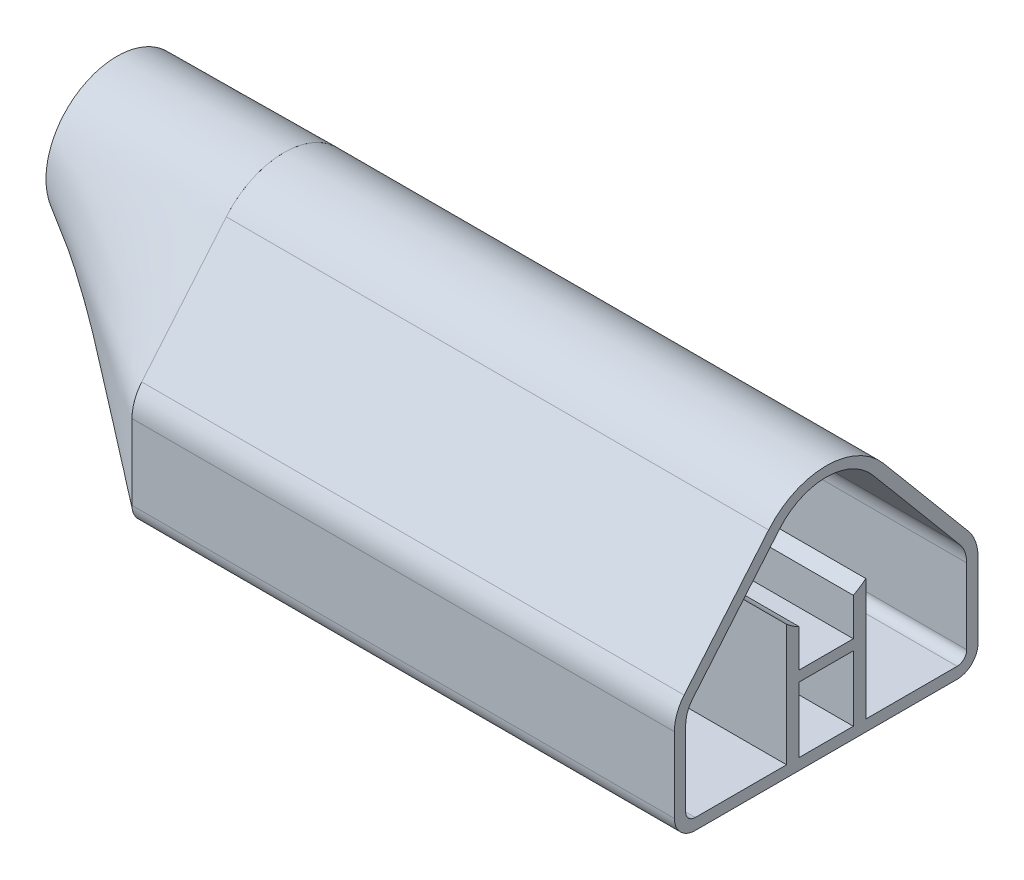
ISO-10303-21;
HEADER;
FILE_DESCRIPTION(('STEP AP214'),'2;1');
FILE_NAME('part.step','',(''),(''),'','','');
FILE_SCHEMA(('AUTOMOTIVE_DESIGN { 1 0 10303 214 1 1 1 1 }'));
ENDSEC;
DATA;
#1=APPLICATION_CONTEXT('core data for automotive mechanical design processes');
#2=APPLICATION_PROTOCOL_DEFINITION('international standard','automotive_design',2000,#1);
#3=PRODUCT_CONTEXT('',#1,'mechanical');
#4=PRODUCT('Part','Part','',(#3));
#5=PRODUCT_RELATED_PRODUCT_CATEGORY('part','',(#4));
#6=PRODUCT_DEFINITION_FORMATION('','',#4);
#7=PRODUCT_DEFINITION_CONTEXT('part definition',#1,'design');
#8=PRODUCT_DEFINITION('design','',#6,#7);
#9=PRODUCT_DEFINITION_SHAPE('','',#8);
#10=(LENGTH_UNIT() NAMED_UNIT(*) SI_UNIT(.MILLI.,.METRE.));
#11=(NAMED_UNIT(*) PLANE_ANGLE_UNIT() SI_UNIT($,.RADIAN.));
#12=(NAMED_UNIT(*) SI_UNIT($,.STERADIAN.) SOLID_ANGLE_UNIT());
#13=UNCERTAINTY_MEASURE_WITH_UNIT(LENGTH_MEASURE(1.E-05),#10,'distance_accuracy_value','');
#14=(GEOMETRIC_REPRESENTATION_CONTEXT(3) GLOBAL_UNCERTAINTY_ASSIGNED_CONTEXT((#13)) GLOBAL_UNIT_ASSIGNED_CONTEXT((#10,
#11,#12)) REPRESENTATION_CONTEXT('',''));
#15=CARTESIAN_POINT('',(0.,0.,0.));
#16=DIRECTION('',(0.,0.,1.));
#17=DIRECTION('',(1.,0.,0.));
#18=AXIS2_PLACEMENT_3D('',#15,#16,#17);
#19=CARTESIAN_POINT('',(40.,-13.5721238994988,-34.0465957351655));
#20=CARTESIAN_POINT('',(26.6666666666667,-11.1063347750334,-27.9773809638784));
#21=CARTESIAN_POINT('',(13.3333333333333,-8.64054564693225,-21.9081661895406));
#22=CARTESIAN_POINT('',(0.,-6.17475652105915,-15.8389514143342));
#23=CARTESIAN_POINT('',(40.,-14.0778411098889,-34.4709428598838));
#24=CARTESIAN_POINT('',(26.6666666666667,-11.5886913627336,-28.1579577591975));
#25=CARTESIAN_POINT('',(13.3333333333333,-9.05311584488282,-21.8950405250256));
#26=CARTESIAN_POINT('',(0.,-6.53698674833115,-15.6977373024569));
#27=CARTESIAN_POINT('',(40.0000000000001,-15.099114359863,-35.1618255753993));
#28=CARTESIAN_POINT('',(26.6666666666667,-12.5641962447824,-28.4277756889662));
#29=CARTESIAN_POINT('',(13.3333333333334,-9.90289756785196,-21.8272586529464));
#30=CARTESIAN_POINT('',(0.,-7.29359729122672,-15.4027754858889));
#31=CARTESIAN_POINT('',(39.9999999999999,-16.6729782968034,-35.8669627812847));
#32=CARTESIAN_POINT('',(26.6666666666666,-14.0649624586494,-28.6488309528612));
#33=CARTESIAN_POINT('',(13.3333333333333,-11.2452936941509,-21.6454846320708));
#34=CARTESIAN_POINT('',(0.,-8.50970179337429,-14.9286816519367));
#35=CARTESIAN_POINT('',(40.0000000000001,-18.2978031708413,-36.2872550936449));
#36=CARTESIAN_POINT('',(26.6666666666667,-15.5983557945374,-28.7156256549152));
#37=CARTESIAN_POINT('',(13.3333333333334,-12.6326125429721,-21.4021570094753));
#38=CARTESIAN_POINT('',(0.,-9.76854818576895,-14.4379250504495));
#39=CARTESIAN_POINT('',(40.,-19.4231409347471,-36.3861513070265));
#40=CARTESIAN_POINT('',(26.6666666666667,-16.6367504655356,-28.6635366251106));
#41=CARTESIAN_POINT('',(13.3333333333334,-13.565368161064,-21.2067929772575));
#42=CARTESIAN_POINT('',(0.,-10.5992638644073,-14.1140736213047));
#43=CARTESIAN_POINT('',(40.,-21.5065422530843,-36.3861513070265));
#44=CARTESIAN_POINT('',(26.6666666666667,-18.5265085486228,-28.472278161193));
#45=CARTESIAN_POINT('',(13.3333333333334,-15.2413064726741,-20.8227039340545));
#46=CARTESIAN_POINT('',(0.,-12.0619043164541,-13.5438686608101));
#47=CARTESIAN_POINT('',(40.,-24.4375370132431,-36.3861513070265));
#48=CARTESIAN_POINT('',(26.6666666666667,-21.1957231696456,-28.2529998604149));
#49=CARTESIAN_POINT('',(13.3333333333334,-17.6708715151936,-20.3233472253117));
#50=CARTESIAN_POINT('',(0.,-14.2299977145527,-12.6986454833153));
#51=CARTESIAN_POINT('',(40.,-28.7708237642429,-36.3861513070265));
#52=CARTESIAN_POINT('',(26.6666666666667,-25.1268646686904,-27.9953117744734));
#53=CARTESIAN_POINT('',(13.3333333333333,-21.3152019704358,-19.6492703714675));
#54=CARTESIAN_POINT('',(0.,-17.527543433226,-11.4131095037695));
#55=CARTESIAN_POINT('',(40.,-33.2000095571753,-36.3861513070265));
#56=CARTESIAN_POINT('',(26.6666666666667,-29.0819972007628,-27.7104919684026));
#57=CARTESIAN_POINT('',(13.3333333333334,-24.9219605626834,-18.9615084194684));
#58=CARTESIAN_POINT('',(0.,-20.7392038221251,-10.1610556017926));
#59=CARTESIAN_POINT('',(40.,-36.3417916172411,-36.3861513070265));
#60=CARTESIAN_POINT('',(26.6666666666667,-31.8188837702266,-27.4342094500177));
#61=CARTESIAN_POINT('',(13.3333333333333,-27.2967724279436,-18.4292999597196));
#62=CARTESIAN_POINT('',(0.,-22.7566177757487,-9.37457424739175));
#63=CARTESIAN_POINT('',(40.,-38.2587069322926,-36.3861513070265));
#64=CARTESIAN_POINT('',(26.6666666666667,-33.4599293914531,-27.2308934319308));
#65=CARTESIAN_POINT('',(13.3333333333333,-28.6610382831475,-18.0831876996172));
#66=CARTESIAN_POINT('',(0.,-23.8647197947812,-8.94258478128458));
#67=CARTESIAN_POINT('',(40.,-38.7594860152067,-36.3522834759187));
#68=CARTESIAN_POINT('',(26.6666666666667,-33.8693893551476,-27.1561652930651));
#69=CARTESIAN_POINT('',(13.3333333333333,-28.9790087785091,-17.9789274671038));
#70=CARTESIAN_POINT('',(0.,-24.0950597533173,-8.81944667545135));
#71=CARTESIAN_POINT('',(40.,-39.5619744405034,-36.1677840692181));
#72=CARTESIAN_POINT('',(26.6666666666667,-34.4923514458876,-26.9555389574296));
#73=CARTESIAN_POINT('',(13.3333333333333,-29.4223274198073,-17.7699623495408));
#74=CARTESIAN_POINT('',(0.,-24.3613879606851,-8.60946755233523));
#75=CARTESIAN_POINT('',(40.,-40.4000135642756,-35.8174928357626));
#76=CARTESIAN_POINT('',(26.6666666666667,-35.1208661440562,-26.6458803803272));
#77=CARTESIAN_POINT('',(13.3333333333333,-29.8413070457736,-17.501644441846));
#78=CARTESIAN_POINT('',(0.,-24.5710736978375,-8.38315620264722));
#79=CARTESIAN_POINT('',(40.,-41.2269950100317,-35.2676263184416));
#80=CARTESIAN_POINT('',(26.6666666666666,-35.7264635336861,-26.2039794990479));
#81=CARTESIAN_POINT('',(13.3333333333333,-30.2255842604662,-17.163461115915));
#82=CARTESIAN_POINT('',(0.,-24.7325836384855,-8.14469509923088));
#83=CARTESIAN_POINT('',(40.0000000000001,-41.9806846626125,-34.503375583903));
#84=CARTESIAN_POINT('',(26.6666666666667,-36.2702565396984,-25.6192759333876));
#85=CARTESIAN_POINT('',(13.3333333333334,-30.5595870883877,-16.7512245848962));
#86=CARTESIAN_POINT('',(0.,-24.8543844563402,-7.89826671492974));
#87=CARTESIAN_POINT('',(39.9999999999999,-42.576527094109,-33.5462277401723));
#88=CARTESIAN_POINT('',(26.6666666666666,-36.6965069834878,-24.9047526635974));
#89=CARTESIAN_POINT('',(13.3333333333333,-30.8163626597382,-16.2715377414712));
#90=CARTESIAN_POINT('',(0.,-24.9390321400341,-7.64609152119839));
#91=CARTESIAN_POINT('',(40.0000000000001,-42.9439187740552,-32.468915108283));
#92=CARTESIAN_POINT('',(26.6666666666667,-36.9587779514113,-24.1075561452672));
#93=CARTESIAN_POINT('',(13.3333333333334,-30.9736087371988,-15.7480852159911));
#94=CARTESIAN_POINT('',(0.,-24.9890826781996,-7.39038998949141));
#95=CARTESIAN_POINT('',(40.,-43.0194988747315,-31.7391486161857));
#96=CARTESIAN_POINT('',(26.6666666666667,-37.012999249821,-23.5657081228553));
#97=CARTESIAN_POINT('',(13.3333333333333,-31.0064996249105,-15.392267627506));
#98=CARTESIAN_POINT('',(0.,-25.,-7.21882713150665));
#99=CARTESIAN_POINT('',(40.,-43.0194988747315,-28.8221348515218));
#100=CARTESIAN_POINT('',(26.6666666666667,-37.012999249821,-21.3848562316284));
#101=CARTESIAN_POINT('',(13.3333333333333,-31.0064996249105,-13.9475776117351));
#102=CARTESIAN_POINT('',(0.,-25.,-6.51029899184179));
#103=CARTESIAN_POINT('',(40.,-43.0194988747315,-23.6443735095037));
#104=CARTESIAN_POINT('',(26.6666666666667,-37.012999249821,-17.5280502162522));
#105=CARTESIAN_POINT('',(13.3333333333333,-31.0064996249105,-11.4117269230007));
#106=CARTESIAN_POINT('',(0.,-25.,-5.29540362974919));
#107=CARTESIAN_POINT('',(40.,-43.0194988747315,-15.779079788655));
#108=CARTESIAN_POINT('',(26.6666666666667,-37.012999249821,-11.6938113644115));
#109=CARTESIAN_POINT('',(13.3333333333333,-31.0064996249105,-7.60854294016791));
#110=CARTESIAN_POINT('',(0.,-25.0000000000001,-3.52327451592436));
#111=CARTESIAN_POINT('',(40.,-43.0194988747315,-7.87293420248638));
#112=CARTESIAN_POINT('',(26.6666666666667,-37.012999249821,-5.83858689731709));
#113=CARTESIAN_POINT('',(13.3333333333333,-31.0064996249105,-3.8042395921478));
#114=CARTESIAN_POINT('',(0.,-25.,-1.76989228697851));
#115=CARTESIAN_POINT('',(40.,-43.0194988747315,-2.61551260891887));
#116=CARTESIAN_POINT('',(26.6666666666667,-37.012999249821,-1.94181634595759));
#117=CARTESIAN_POINT('',(13.3333333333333,-31.0064996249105,-1.2681200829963));
#118=CARTESIAN_POINT('',(0.,-25.,-0.594423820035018));
#119=CARTESIAN_POINT('',(40.,-43.0194988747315,2.61551260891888));
#120=CARTESIAN_POINT('',(26.6666666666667,-37.012999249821,1.94181634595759));
#121=CARTESIAN_POINT('',(13.3333333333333,-31.0064996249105,1.2681200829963));
#122=CARTESIAN_POINT('',(0.,-25.,0.59442382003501));
#123=CARTESIAN_POINT('',(40.,-43.0194988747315,7.87293420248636));
#124=CARTESIAN_POINT('',(26.6666666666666,-37.012999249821,5.83858689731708));
#125=CARTESIAN_POINT('',(13.3333333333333,-31.0064996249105,3.80423959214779));
#126=CARTESIAN_POINT('',(0.,-25.,1.7698922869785));
#127=CARTESIAN_POINT('',(40.,-43.0194988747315,15.779079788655));
#128=CARTESIAN_POINT('',(26.6666666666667,-37.012999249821,11.6938113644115));
#129=CARTESIAN_POINT('',(13.3333333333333,-31.0064996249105,7.60854294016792));
#130=CARTESIAN_POINT('',(0.,-25.,3.52327451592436));
#131=CARTESIAN_POINT('',(40.,-43.0194988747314,23.6443735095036));
#132=CARTESIAN_POINT('',(26.6666666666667,-37.012999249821,17.5280502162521));
#133=CARTESIAN_POINT('',(13.3333333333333,-31.0064996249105,11.4117269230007));
#134=CARTESIAN_POINT('',(0.,-25.,5.29540362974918));
#135=CARTESIAN_POINT('',(40.,-43.0194988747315,28.8221348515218));
#136=CARTESIAN_POINT('',(26.6666666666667,-37.012999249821,21.3848562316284));
#137=CARTESIAN_POINT('',(13.3333333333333,-31.0064996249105,13.9475776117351));
#138=CARTESIAN_POINT('',(0.,-25.,6.51029899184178));
#139=CARTESIAN_POINT('',(40.,-43.0194988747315,31.7391486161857));
#140=CARTESIAN_POINT('',(26.6666666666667,-37.012999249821,23.5657081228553));
#141=CARTESIAN_POINT('',(13.3333333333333,-31.0064996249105,15.392267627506));
#142=CARTESIAN_POINT('',(0.,-25.,7.21882713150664));
#143=CARTESIAN_POINT('',(40.,-42.9439187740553,32.4689151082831));
#144=CARTESIAN_POINT('',(26.6666666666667,-36.9587779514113,24.1075561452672));
#145=CARTESIAN_POINT('',(13.3333333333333,-30.9736087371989,15.7480852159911));
#146=CARTESIAN_POINT('',(0.,-24.9890826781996,7.39038998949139));
#147=CARTESIAN_POINT('',(40.,-42.5765270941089,33.5462277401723));
#148=CARTESIAN_POINT('',(26.6666666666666,-36.6965069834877,24.9047526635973));
#149=CARTESIAN_POINT('',(13.3333333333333,-30.8163626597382,16.2715377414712));
#150=CARTESIAN_POINT('',(0.,-24.9390321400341,7.64609152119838));
#151=CARTESIAN_POINT('',(40.,-41.9806846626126,34.5033755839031));
#152=CARTESIAN_POINT('',(26.6666666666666,-36.2702565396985,25.6192759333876));
#153=CARTESIAN_POINT('',(13.3333333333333,-30.5595870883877,16.7512245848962));
#154=CARTESIAN_POINT('',(0.,-24.8543844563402,7.89826671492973));
#155=CARTESIAN_POINT('',(40.,-41.2269950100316,35.2676263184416));
#156=CARTESIAN_POINT('',(26.6666666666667,-35.7264635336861,26.2039794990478));
#157=CARTESIAN_POINT('',(13.3333333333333,-30.2255842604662,17.163461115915));
#158=CARTESIAN_POINT('',(0.,-24.7325836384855,8.14469509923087));
#159=CARTESIAN_POINT('',(40.,-40.4000135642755,35.8174928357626));
#160=CARTESIAN_POINT('',(26.6666666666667,-35.1208661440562,26.6458803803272));
#161=CARTESIAN_POINT('',(13.3333333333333,-29.8413070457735,17.501644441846));
#162=CARTESIAN_POINT('',(0.,-24.5710736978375,8.38315620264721));
#163=CARTESIAN_POINT('',(40.,-39.5619744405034,36.1677840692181));
#164=CARTESIAN_POINT('',(26.6666666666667,-34.4923514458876,26.9555389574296));
#165=CARTESIAN_POINT('',(13.3333333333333,-29.4223274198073,17.7699623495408));
#166=CARTESIAN_POINT('',(0.,-24.3613879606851,8.60946755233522));
#167=CARTESIAN_POINT('',(40.,-38.7594860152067,36.3522834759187));
#168=CARTESIAN_POINT('',(26.6666666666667,-33.8693893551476,27.1561652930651));
#169=CARTESIAN_POINT('',(13.3333333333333,-28.9790087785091,17.9789274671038));
#170=CARTESIAN_POINT('',(0.,-24.0950597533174,8.81944667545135));
#171=CARTESIAN_POINT('',(40.,-38.2587069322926,36.3861513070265));
#172=CARTESIAN_POINT('',(26.6666666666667,-33.4599293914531,27.2308934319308));
#173=CARTESIAN_POINT('',(13.3333333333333,-28.6610382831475,18.0831876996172));
#174=CARTESIAN_POINT('',(0.,-23.8647197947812,8.94258478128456));
#175=CARTESIAN_POINT('',(40.,-36.3417916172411,36.3861513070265));
#176=CARTESIAN_POINT('',(26.6666666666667,-31.8188837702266,27.4342094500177));
#177=CARTESIAN_POINT('',(13.3333333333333,-27.2967724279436,18.4292999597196));
#178=CARTESIAN_POINT('',(0.,-22.7566177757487,9.37457424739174));
#179=CARTESIAN_POINT('',(40.,-33.2000095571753,36.3861513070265));
#180=CARTESIAN_POINT('',(26.6666666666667,-29.0819972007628,27.7104919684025));
#181=CARTESIAN_POINT('',(13.3333333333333,-24.9219605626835,18.9615084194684));
#182=CARTESIAN_POINT('',(0.,-20.7392038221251,10.1610556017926));
#183=CARTESIAN_POINT('',(40.,-28.7708237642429,36.3861513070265));
#184=CARTESIAN_POINT('',(26.6666666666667,-25.1268646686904,27.9953117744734));
#185=CARTESIAN_POINT('',(13.3333333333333,-21.3152019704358,19.6492703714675));
#186=CARTESIAN_POINT('',(0.,-17.527543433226,11.4131095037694));
#187=CARTESIAN_POINT('',(40.,-24.4375370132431,36.3861513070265));
#188=CARTESIAN_POINT('',(26.6666666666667,-21.1957231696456,28.2529998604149));
#189=CARTESIAN_POINT('',(13.3333333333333,-17.6708715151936,20.3233472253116));
#190=CARTESIAN_POINT('',(0.,-14.2299977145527,12.6986454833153));
#191=CARTESIAN_POINT('',(40.,-21.5065422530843,36.3861513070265));
#192=CARTESIAN_POINT('',(26.6666666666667,-18.5265085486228,28.472278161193));
#193=CARTESIAN_POINT('',(13.3333333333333,-15.2413064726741,20.8227039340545));
#194=CARTESIAN_POINT('',(0.,-12.0619043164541,13.5438686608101));
#195=CARTESIAN_POINT('',(40.,-19.4231409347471,36.3861513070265));
#196=CARTESIAN_POINT('',(26.6666666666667,-16.6367504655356,28.6635366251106));
#197=CARTESIAN_POINT('',(13.3333333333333,-13.565368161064,21.2067929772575));
#198=CARTESIAN_POINT('',(0.,-10.5992638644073,14.1140736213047));
#199=CARTESIAN_POINT('',(39.9999999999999,-18.2978031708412,36.2872550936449));
#200=CARTESIAN_POINT('',(26.6666666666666,-15.5983557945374,28.7156256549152));
#201=CARTESIAN_POINT('',(13.3333333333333,-12.6326125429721,21.4021570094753));
#202=CARTESIAN_POINT('',(0.,-9.76854818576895,14.4379250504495));
#203=CARTESIAN_POINT('',(40.0000000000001,-16.6729782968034,35.8669627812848));
#204=CARTESIAN_POINT('',(26.6666666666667,-14.0649624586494,28.6488309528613));
#205=CARTESIAN_POINT('',(13.3333333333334,-11.2452936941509,21.6454846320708));
#206=CARTESIAN_POINT('',(0.,-8.50970179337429,14.9286816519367));
#207=CARTESIAN_POINT('',(39.9999999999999,-15.099114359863,35.1618255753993));
#208=CARTESIAN_POINT('',(26.6666666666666,-12.5641962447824,28.4277756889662));
#209=CARTESIAN_POINT('',(13.3333333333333,-9.90289756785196,21.8272586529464));
#210=CARTESIAN_POINT('',(0.,-7.29359729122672,15.4027754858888));
#211=CARTESIAN_POINT('',(40.,-14.0778411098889,34.4709428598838));
#212=CARTESIAN_POINT('',(26.6666666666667,-11.5886913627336,28.1579577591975));
#213=CARTESIAN_POINT('',(13.3333333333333,-9.05311584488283,21.8950405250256));
#214=CARTESIAN_POINT('',(0.,-6.53698674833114,15.6977373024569));
#215=CARTESIAN_POINT('',(40.,-11.6203161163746,32.408834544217));
#216=CARTESIAN_POINT('',(26.6666666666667,-9.24468695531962,27.2804476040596));
#217=CARTESIAN_POINT('',(13.3333333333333,-7.04823732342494,21.9588244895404));
#218=CARTESIAN_POINT('',(0.,-4.77673453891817,16.3839651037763));
#219=CARTESIAN_POINT('',(40.,-7.53377309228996,28.9798177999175));
#220=CARTESIAN_POINT('',(26.6666666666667,-5.48758123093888,25.431750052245));
#221=CARTESIAN_POINT('',(13.3333333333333,-3.79769181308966,21.4996542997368));
#222=CARTESIAN_POINT('',(0.,-1.95574032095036,17.0636117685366));
#223=CARTESIAN_POINT('',(40.,-1.15318260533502,23.6258666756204));
#224=CARTESIAN_POINT('',(26.6666666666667,0.135871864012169,21.7632227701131));
#225=CARTESIAN_POINT('',(13.3333333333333,1.14044360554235,19.5945141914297));
#226=CARTESIAN_POINT('',(0.,2.27333296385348,17.0225054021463));
#227=CARTESIAN_POINT('',(40.,3.99485280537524,19.3061520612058));
#228=CARTESIAN_POINT('',(26.6666666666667,4.63258927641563,18.3810723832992));
#229=CARTESIAN_POINT('',(13.3333333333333,5.155109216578,17.332614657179));
#230=CARTESIAN_POINT('',(0.,5.73680679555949,16.1198443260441));
#231=CARTESIAN_POINT('',(40.,7.84913965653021,16.0720213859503));
#232=CARTESIAN_POINT('',(26.6666666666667,8.04915863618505,15.6760392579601));
#233=CARTESIAN_POINT('',(13.3333333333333,8.23192171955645,15.2620134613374));
#234=CARTESIAN_POINT('',(0.,8.42895586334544,14.8226475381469));
#235=CARTESIAN_POINT('',(40.,9.68043827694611,14.5353793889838));
#236=CARTESIAN_POINT('',(26.6666666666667,9.69800817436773,14.3402279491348));
#237=CARTESIAN_POINT('',(13.3333333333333,9.71763468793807,14.1475208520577));
#238=CARTESIAN_POINT('',(0.,9.73921696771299,13.9573395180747));
#239=CARTESIAN_POINT('',(40.,11.1877423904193,13.2706010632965));
#240=CARTESIAN_POINT('',(26.6666666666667,11.0694830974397,13.2211193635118));
#241=CARTESIAN_POINT('',(13.3333333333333,10.9497963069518,13.1699410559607));
#242=CARTESIAN_POINT('',(0.,10.8287520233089,13.1170096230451));
#243=CARTESIAN_POINT('',(40.,12.2692321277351,12.2249556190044));
#244=CARTESIAN_POINT('',(26.6666666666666,12.0874028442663,12.2755539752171));
#245=CARTESIAN_POINT('',(13.3333333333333,11.9020048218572,12.3219108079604));
#246=CARTESIAN_POINT('',(0.,11.7132130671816,12.3638848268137));
#247=CARTESIAN_POINT('',(40.0000000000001,13.5780619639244,10.6215904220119));
#248=CARTESIAN_POINT('',(26.6666666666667,13.3826499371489,10.7656519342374));
#249=CARTESIAN_POINT('',(13.3333333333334,13.1821970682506,10.9037222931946));
#250=CARTESIAN_POINT('',(0.,12.9769505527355,11.0356019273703));
#251=CARTESIAN_POINT('',(39.9999999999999,14.6395739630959,8.97919494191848));
#252=CARTESIAN_POINT('',(26.6666666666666,14.4780698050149,9.16025725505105));
#253=CARTESIAN_POINT('',(13.3333333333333,14.311390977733,9.33516935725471));
#254=CARTESIAN_POINT('',(0.,14.1397912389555,9.50372637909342));
#255=CARTESIAN_POINT('',(40.0000000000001,15.7743447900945,6.7328209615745));
#256=CARTESIAN_POINT('',(26.6666666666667,15.6846800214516,6.90101214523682));
#257=CARTESIAN_POINT('',(13.3333333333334,15.5909112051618,7.06432557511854));
#258=CARTESIAN_POINT('',(0.,15.4932395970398,7.22259876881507));
#259=CARTESIAN_POINT('',(40.,16.7199955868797,3.80738144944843));
#260=CARTESIAN_POINT('',(26.6666666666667,16.7142412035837,3.86840977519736));
#261=CARTESIAN_POINT('',(13.3333333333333,16.7070593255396,3.92774149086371));
#262=CARTESIAN_POINT('',(0.,16.6985199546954,3.98532008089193));
#263=CARTESIAN_POINT('',(40.,17.,1.30899692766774));
#264=CARTESIAN_POINT('',(26.6666666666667,17.,1.30418996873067));
#265=CARTESIAN_POINT('',(13.3333333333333,17.,1.2993830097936));
#266=CARTESIAN_POINT('',(0.,17.,1.29457605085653));
#267=CARTESIAN_POINT('',(40.,17.,-1.30899692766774));
#268=CARTESIAN_POINT('',(26.6666666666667,17.,-1.30418996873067));
#269=CARTESIAN_POINT('',(13.3333333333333,17.,-1.2993830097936));
#270=CARTESIAN_POINT('',(0.,17.,-1.29457605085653));
#271=CARTESIAN_POINT('',(40.,16.7199955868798,-3.80738144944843));
#272=CARTESIAN_POINT('',(26.6666666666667,16.7142412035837,-3.86840977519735));
#273=CARTESIAN_POINT('',(13.3333333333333,16.7070593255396,-3.9277414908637));
#274=CARTESIAN_POINT('',(0.,16.6985199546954,-3.98532008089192));
#275=CARTESIAN_POINT('',(40.,15.7743447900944,-6.73282096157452));
#276=CARTESIAN_POINT('',(26.6666666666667,15.6846800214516,-6.90101214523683));
#277=CARTESIAN_POINT('',(13.3333333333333,15.5909112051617,-7.06432557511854));
#278=CARTESIAN_POINT('',(0.,15.4932395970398,-7.22259876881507));
#279=CARTESIAN_POINT('',(40.,14.639573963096,-8.97919494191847));
#280=CARTESIAN_POINT('',(26.6666666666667,14.478069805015,-9.16025725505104));
#281=CARTESIAN_POINT('',(13.3333333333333,14.311390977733,-9.33516935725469));
#282=CARTESIAN_POINT('',(0.,14.1397912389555,-9.50372637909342));
#283=CARTESIAN_POINT('',(40.,13.5780619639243,-10.6215904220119));
#284=CARTESIAN_POINT('',(26.6666666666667,13.3826499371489,-10.7656519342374));
#285=CARTESIAN_POINT('',(13.3333333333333,13.1821970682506,-10.9037222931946));
#286=CARTESIAN_POINT('',(0.,12.9769505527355,-11.0356019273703));
#287=CARTESIAN_POINT('',(40.,12.2692321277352,-12.2249556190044));
#288=CARTESIAN_POINT('',(26.6666666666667,12.0874028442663,-12.2755539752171));
#289=CARTESIAN_POINT('',(13.3333333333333,11.9020048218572,-12.3219108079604));
#290=CARTESIAN_POINT('',(0.,11.7132130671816,-12.3638848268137));
#291=CARTESIAN_POINT('',(40.,11.1877423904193,-13.2706010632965));
#292=CARTESIAN_POINT('',(26.6666666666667,11.0694830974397,-13.2211193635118));
#293=CARTESIAN_POINT('',(13.3333333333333,10.9497963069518,-13.1699410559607));
#294=CARTESIAN_POINT('',(0.,10.8287520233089,-13.1170096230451));
#295=CARTESIAN_POINT('',(40.,9.68043827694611,-14.5353793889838));
#296=CARTESIAN_POINT('',(26.6666666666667,9.69800817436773,-14.3402279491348));
#297=CARTESIAN_POINT('',(13.3333333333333,9.71763468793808,-14.1475208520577));
#298=CARTESIAN_POINT('',(0.,9.739216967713,-13.9573395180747));
#299=CARTESIAN_POINT('',(40.,7.84913965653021,-16.0720213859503));
#300=CARTESIAN_POINT('',(26.6666666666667,8.04915863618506,-15.6760392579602));
#301=CARTESIAN_POINT('',(13.3333333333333,8.23192171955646,-15.2620134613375));
#302=CARTESIAN_POINT('',(0.,8.42895586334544,-14.8226475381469));
#303=CARTESIAN_POINT('',(40.,3.99485280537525,-19.3061520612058));
#304=CARTESIAN_POINT('',(26.6666666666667,4.63258927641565,-18.3810723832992));
#305=CARTESIAN_POINT('',(13.3333333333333,5.15510921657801,-17.332614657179));
#306=CARTESIAN_POINT('',(0.,5.73680679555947,-16.1198443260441));
#307=CARTESIAN_POINT('',(40.,-1.15318260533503,-23.6258666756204));
#308=CARTESIAN_POINT('',(26.6666666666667,0.135871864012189,-21.7632227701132));
#309=CARTESIAN_POINT('',(13.3333333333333,1.14044360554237,-19.5945141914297));
#310=CARTESIAN_POINT('',(0.,2.27333296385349,-17.0225054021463));
#311=CARTESIAN_POINT('',(40.,-7.53377309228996,-28.9798177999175));
#312=CARTESIAN_POINT('',(26.6666666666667,-5.48758123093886,-25.431750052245));
#313=CARTESIAN_POINT('',(13.3333333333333,-3.79769181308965,-21.4996542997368));
#314=CARTESIAN_POINT('',(0.,-1.95574032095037,-17.0636117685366));
#315=CARTESIAN_POINT('',(40.,-11.6203161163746,-32.408834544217));
#316=CARTESIAN_POINT('',(26.6666666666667,-9.24468695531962,-27.2804476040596));
#317=CARTESIAN_POINT('',(13.3333333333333,-7.04823732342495,-21.9588244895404));
#318=CARTESIAN_POINT('',(0.,-4.77673453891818,-16.3839651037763));
#319=CARTESIAN_POINT('',(40.,-13.5721238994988,-34.0465957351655));
#320=CARTESIAN_POINT('',(26.6666666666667,-11.1063347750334,-27.9773809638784));
#321=CARTESIAN_POINT('',(13.3333333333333,-8.64054564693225,-21.9081661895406));
#322=CARTESIAN_POINT('',(0.,-6.17475652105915,-15.8389514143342));
#323=B_SPLINE_SURFACE_WITH_KNOTS('',3,3,((#19,#20,#21,#22),(#23,#24,#25,#26),(#27,#28,#29,#30),
(#31,#32,#33,#34),(#35,#36,#37,#38),(#39,#40,#41,#42),(#43,#44,#45,#46),(#47,#48,#49,#50),(#51,
#52,#53,#54),(#55,#56,#57,#58),(#59,#60,#61,#62),(#63,#64,#65,#66),(#67,#68,#69,#70),(#71,#72,
#73,#74),(#75,#76,#77,#78),(#79,#80,#81,#82),(#83,#84,#85,#86),(#87,#88,#89,#90),(#91,#92,#93,
#94),(#95,#96,#97,#98),(#99,#100,#101,#102),(#103,#104,#105,#106),(#107,#108,#109,#110),(#111,
#112,#113,#114),(#115,#116,#117,#118),(#119,#120,#121,#122),(#123,#124,#125,#126),(#127,#128,
#129,#130),(#131,#132,#133,#134),(#135,#136,#137,#138),(#139,#140,#141,#142),(#143,#144,#145,
#146),(#147,#148,#149,#150),(#151,#152,#153,#154),(#155,#156,#157,#158),(#159,#160,#161,#162),
(#163,#164,#165,#166),(#167,#168,#169,#170),(#171,#172,#173,#174),(#175,#176,#177,#178),(#179,
#180,#181,#182),(#183,#184,#185,#186),(#187,#188,#189,#190),(#191,#192,#193,#194),(#195,#196,
#197,#198),(#199,#200,#201,#202),(#203,#204,#205,#206),(#207,#208,#209,#210),(#211,#212,#213,
#214),(#215,#216,#217,#218),(#219,#220,#221,#222),(#223,#224,#225,#226),(#227,#228,#229,#230),
(#231,#232,#233,#234),(#235,#236,#237,#238),(#239,#240,#241,#242),(#243,#244,#245,#246),(#247,
#248,#249,#250),(#251,#252,#253,#254),(#255,#256,#257,#258),(#259,#260,#261,#262),(#263,#264,
#265,#266),(#267,#268,#269,#270),(#271,#272,#273,#274),(#275,#276,#277,#278),(#279,#280,#281,
#282),(#283,#284,#285,#286),(#287,#288,#289,#290),(#291,#292,#293,#294),(#295,#296,#297,#298),
(#299,#300,#301,#302),(#303,#304,#305,#306),(#307,#308,#309,#310),(#311,#312,#313,#314),(#315,
#316,#317,#318),(#319,#320,#321,#322)),.UNSPECIFIED.,.T.,.F.,.F.,(4,1,1,1,2,1,1,1,2,1,1,1,1,1,1,
1,2,1,1,1,2,1,1,1,2,1,1,1,1,1,1,1,2,1,1,1,2,1,1,1,2,1,1,1,1,2,1,1,1,1,1,2,1,1,1,1,1,2,1,1,1,1,
4),(4,4),(0.,0.00919157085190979,0.0183831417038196,0.0275747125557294,0.0367662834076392,
0.0607712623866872,0.0847762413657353,0.108781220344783,0.132786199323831,0.136208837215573,
0.139631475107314,0.143054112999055,0.146476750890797,0.149899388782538,0.153322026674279,
0.156744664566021,0.160167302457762,0.185027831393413,0.209888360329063,0.234748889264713,
0.259609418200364,0.284469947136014,0.309330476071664,0.334191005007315,0.359051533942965,
0.362474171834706,0.365896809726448,0.369319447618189,0.37274208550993,0.376164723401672,
0.379587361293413,0.383009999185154,0.386432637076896,0.410437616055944,0.434442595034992,
0.45844757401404,0.482452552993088,0.491644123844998,0.500835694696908,0.510027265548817,
0.519218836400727,0.55469356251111,0.590168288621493,0.625643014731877,0.643380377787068,
0.66111774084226,0.673429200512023,0.685740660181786,0.698052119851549,0.710363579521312,
0.734986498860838,0.759609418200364,0.784232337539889,0.808855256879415,0.821166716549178,
0.833478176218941,0.845789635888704,0.858101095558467,0.875838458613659,0.89357582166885,
0.929050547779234,0.964525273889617,1.),(0.,1.),.UNSPECIFIED.);
#324=CARTESIAN_POINT('',(40.,-13.5721238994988,-34.0465957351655));
#325=CARTESIAN_POINT('',(40.,-14.0778411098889,-34.4709428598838));
#326=CARTESIAN_POINT('',(40.0000000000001,-15.099114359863,-35.1618255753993));
#327=CARTESIAN_POINT('',(39.9999999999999,-16.6729782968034,-35.8669627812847));
#328=CARTESIAN_POINT('',(40.0000000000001,-18.2978031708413,-36.2872550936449));
#329=CARTESIAN_POINT('',(40.,-19.4231409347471,-36.3861513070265));
#330=CARTESIAN_POINT('',(40.,-21.5065422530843,-36.3861513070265));
#331=CARTESIAN_POINT('',(40.,-24.4375370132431,-36.3861513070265));
#332=CARTESIAN_POINT('',(40.,-28.7708237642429,-36.3861513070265));
#333=CARTESIAN_POINT('',(40.,-33.2000095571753,-36.3861513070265));
#334=CARTESIAN_POINT('',(40.,-36.3417916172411,-36.3861513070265));
#335=CARTESIAN_POINT('',(40.,-38.2587069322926,-36.3861513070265));
#336=CARTESIAN_POINT('',(40.,-38.7594860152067,-36.3522834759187));
#337=CARTESIAN_POINT('',(40.,-39.5619744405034,-36.1677840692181));
#338=CARTESIAN_POINT('',(40.,-40.4000135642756,-35.8174928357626));
#339=CARTESIAN_POINT('',(40.,-41.2269950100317,-35.2676263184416));
#340=CARTESIAN_POINT('',(40.0000000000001,-41.9806846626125,-34.503375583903));
#341=CARTESIAN_POINT('',(39.9999999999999,-42.576527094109,-33.5462277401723));
#342=CARTESIAN_POINT('',(40.0000000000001,-42.9439187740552,-32.468915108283));
#343=CARTESIAN_POINT('',(40.,-43.0194988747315,-31.7391486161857));
#344=CARTESIAN_POINT('',(40.,-43.0194988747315,-28.8221348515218));
#345=CARTESIAN_POINT('',(40.,-43.0194988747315,-23.6443735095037));
#346=CARTESIAN_POINT('',(40.,-43.0194988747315,-15.779079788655));
#347=CARTESIAN_POINT('',(40.,-43.0194988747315,-7.87293420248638));
#348=CARTESIAN_POINT('',(40.,-43.0194988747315,-2.61551260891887));
#349=CARTESIAN_POINT('',(40.,-43.0194988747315,2.61551260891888));
#350=CARTESIAN_POINT('',(40.,-43.0194988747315,7.87293420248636));
#351=CARTESIAN_POINT('',(40.,-43.0194988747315,15.779079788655));
#352=CARTESIAN_POINT('',(40.,-43.0194988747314,23.6443735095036));
#353=CARTESIAN_POINT('',(40.,-43.0194988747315,28.8221348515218));
#354=CARTESIAN_POINT('',(40.,-43.0194988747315,31.7391486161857));
#355=CARTESIAN_POINT('',(40.,-42.9439187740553,32.4689151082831));
#356=CARTESIAN_POINT('',(40.,-42.5765270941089,33.5462277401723));
#357=CARTESIAN_POINT('',(40.,-41.9806846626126,34.5033755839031));
#358=CARTESIAN_POINT('',(40.,-41.2269950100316,35.2676263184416));
#359=CARTESIAN_POINT('',(40.,-40.4000135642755,35.8174928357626));
#360=CARTESIAN_POINT('',(40.,-39.5619744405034,36.1677840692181));
#361=CARTESIAN_POINT('',(40.,-38.7594860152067,36.3522834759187));
#362=CARTESIAN_POINT('',(40.,-38.2587069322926,36.3861513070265));
#363=CARTESIAN_POINT('',(40.,-36.3417916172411,36.3861513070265));
#364=CARTESIAN_POINT('',(40.,-33.2000095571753,36.3861513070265));
#365=CARTESIAN_POINT('',(40.,-28.7708237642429,36.3861513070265));
#366=CARTESIAN_POINT('',(40.,-24.4375370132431,36.3861513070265));
#367=CARTESIAN_POINT('',(40.,-21.5065422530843,36.3861513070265));
#368=CARTESIAN_POINT('',(40.,-19.4231409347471,36.3861513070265));
#369=CARTESIAN_POINT('',(39.9999999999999,-18.2978031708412,36.2872550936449));
#370=CARTESIAN_POINT('',(40.0000000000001,-16.6729782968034,35.8669627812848));
#371=CARTESIAN_POINT('',(39.9999999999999,-15.099114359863,35.1618255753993));
#372=CARTESIAN_POINT('',(40.,-14.0778411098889,34.4709428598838));
#373=CARTESIAN_POINT('',(40.,-11.6203161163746,32.408834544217));
#374=CARTESIAN_POINT('',(40.,-7.53377309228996,28.9798177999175));
#375=CARTESIAN_POINT('',(40.,-1.15318260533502,23.6258666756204));
#376=CARTESIAN_POINT('',(40.,3.99485280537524,19.3061520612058));
#377=CARTESIAN_POINT('',(40.,7.84913965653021,16.0720213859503));
#378=CARTESIAN_POINT('',(40.,9.68043827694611,14.5353793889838));
#379=CARTESIAN_POINT('',(40.,11.1877423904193,13.2706010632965));
#380=CARTESIAN_POINT('',(40.,12.2692321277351,12.2249556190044));
#381=CARTESIAN_POINT('',(40.0000000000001,13.5780619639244,10.6215904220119));
#382=CARTESIAN_POINT('',(39.9999999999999,14.6395739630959,8.97919494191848));
#383=CARTESIAN_POINT('',(40.0000000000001,15.7743447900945,6.7328209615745));
#384=CARTESIAN_POINT('',(40.,16.7199955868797,3.80738144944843));
#385=CARTESIAN_POINT('',(40.,17.,1.30899692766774));
#386=CARTESIAN_POINT('',(40.,17.,-1.30899692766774));
#387=CARTESIAN_POINT('',(40.,16.7199955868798,-3.80738144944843));
#388=CARTESIAN_POINT('',(40.,15.7743447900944,-6.73282096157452));
#389=CARTESIAN_POINT('',(40.,14.639573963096,-8.97919494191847));
#390=CARTESIAN_POINT('',(40.,13.5780619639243,-10.6215904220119));
#391=CARTESIAN_POINT('',(40.,12.2692321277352,-12.2249556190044));
#392=CARTESIAN_POINT('',(40.,11.1877423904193,-13.2706010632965));
#393=CARTESIAN_POINT('',(40.,9.68043827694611,-14.5353793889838));
#394=CARTESIAN_POINT('',(40.,7.84913965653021,-16.0720213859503));
#395=CARTESIAN_POINT('',(40.,3.99485280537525,-19.3061520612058));
#396=CARTESIAN_POINT('',(40.,-1.15318260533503,-23.6258666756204));
#397=CARTESIAN_POINT('',(40.,-7.53377309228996,-28.9798177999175));
#398=CARTESIAN_POINT('',(40.,-11.6203161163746,-32.408834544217));
#399=CARTESIAN_POINT('',(40.,-13.5721238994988,-34.0465957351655));
#400=B_SPLINE_CURVE_WITH_KNOTS('',3,(#324,#325,#326,#327,#328,#329,#330,#331,#332,#333,#334,
#335,#336,#337,#338,#339,#340,#341,#342,#343,#344,#345,#346,#347,#348,#349,#350,#351,#352,#353,
#354,#355,#356,#357,#358,#359,#360,#361,#362,#363,#364,#365,#366,#367,#368,#369,#370,#371,#372,
#373,#374,#375,#376,#377,#378,#379,#380,#381,#382,#383,#384,#385,#386,#387,#388,#389,#390,#391,
#392,#393,#394,#395,#396,#397,#398,#399),.UNSPECIFIED.,.T.,.F.,(4,1,1,1,2,1,1,1,2,1,1,1,1,1,1,1,
2,1,1,1,2,1,1,1,2,1,1,1,1,1,1,1,2,1,1,1,2,1,1,1,2,1,1,1,1,2,1,1,1,1,1,2,1,1,1,1,1,2,1,1,1,1,4),
(0.,0.00919157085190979,0.0183831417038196,0.0275747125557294,0.0367662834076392,
0.0607712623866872,0.0847762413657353,0.108781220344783,0.132786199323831,0.136208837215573,
0.139631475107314,0.143054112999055,0.146476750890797,0.149899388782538,0.153322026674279,
0.156744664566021,0.160167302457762,0.185027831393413,0.209888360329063,0.234748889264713,
0.259609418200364,0.284469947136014,0.309330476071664,0.334191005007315,0.359051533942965,
0.362474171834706,0.365896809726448,0.369319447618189,0.37274208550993,0.376164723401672,
0.379587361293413,0.383009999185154,0.386432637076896,0.410437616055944,0.434442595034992,
0.45844757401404,0.482452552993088,0.491644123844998,0.500835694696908,0.510027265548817,
0.519218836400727,0.55469356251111,0.590168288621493,0.625643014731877,0.643380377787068,
0.66111774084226,0.673429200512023,0.685740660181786,0.698052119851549,0.710363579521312,
0.734986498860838,0.759609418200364,0.784232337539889,0.808855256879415,0.821166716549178,
0.833478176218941,0.845789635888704,0.858101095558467,0.875838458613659,0.89357582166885,
0.929050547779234,0.964525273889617,1.),.UNSPECIFIED.);
#401=CARTESIAN_POINT('',(40.,-13.5721238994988,-34.0465957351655));
#402=VERTEX_POINT('',#401);
#403=EDGE_CURVE('E13',#402,#402,#400,.T.);
#404=CARTESIAN_POINT('',(0.,-6.17475652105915,-15.8389514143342));
#405=CARTESIAN_POINT('',(0.,-6.53698674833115,-15.6977373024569));
#406=CARTESIAN_POINT('',(0.,-7.29359729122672,-15.4027754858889));
#407=CARTESIAN_POINT('',(0.,-8.50970179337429,-14.9286816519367));
#408=CARTESIAN_POINT('',(0.,-9.76854818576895,-14.4379250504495));
#409=CARTESIAN_POINT('',(0.,-10.5992638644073,-14.1140736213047));
#410=CARTESIAN_POINT('',(0.,-12.0619043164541,-13.5438686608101));
#411=CARTESIAN_POINT('',(0.,-14.2299977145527,-12.6986454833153));
#412=CARTESIAN_POINT('',(0.,-17.527543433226,-11.4131095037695));
#413=CARTESIAN_POINT('',(0.,-20.7392038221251,-10.1610556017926));
#414=CARTESIAN_POINT('',(0.,-22.7566177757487,-9.37457424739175));
#415=CARTESIAN_POINT('',(0.,-23.8647197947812,-8.94258478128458));
#416=CARTESIAN_POINT('',(0.,-24.0950597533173,-8.81944667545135));
#417=CARTESIAN_POINT('',(0.,-24.3613879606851,-8.60946755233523));
#418=CARTESIAN_POINT('',(0.,-24.5710736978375,-8.38315620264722));
#419=CARTESIAN_POINT('',(0.,-24.7325836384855,-8.14469509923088));
#420=CARTESIAN_POINT('',(0.,-24.8543844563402,-7.89826671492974));
#421=CARTESIAN_POINT('',(0.,-24.9390321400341,-7.64609152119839));
#422=CARTESIAN_POINT('',(0.,-24.9890826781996,-7.39038998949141));
#423=CARTESIAN_POINT('',(0.,-25.,-7.21882713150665));
#424=CARTESIAN_POINT('',(0.,-25.,-6.51029899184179));
#425=CARTESIAN_POINT('',(0.,-25.,-5.29540362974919));
#426=CARTESIAN_POINT('',(0.,-25.0000000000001,-3.52327451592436));
#427=CARTESIAN_POINT('',(0.,-25.,-1.76989228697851));
#428=CARTESIAN_POINT('',(0.,-25.,-0.594423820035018));
#429=CARTESIAN_POINT('',(0.,-25.,0.59442382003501));
#430=CARTESIAN_POINT('',(0.,-25.,1.7698922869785));
#431=CARTESIAN_POINT('',(0.,-25.,3.52327451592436));
#432=CARTESIAN_POINT('',(0.,-25.,5.29540362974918));
#433=CARTESIAN_POINT('',(0.,-25.,6.51029899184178));
#434=CARTESIAN_POINT('',(0.,-25.,7.21882713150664));
#435=CARTESIAN_POINT('',(0.,-24.9890826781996,7.39038998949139));
#436=CARTESIAN_POINT('',(0.,-24.9390321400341,7.64609152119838));
#437=CARTESIAN_POINT('',(0.,-24.8543844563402,7.89826671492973));
#438=CARTESIAN_POINT('',(0.,-24.7325836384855,8.14469509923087));
#439=CARTESIAN_POINT('',(0.,-24.5710736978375,8.38315620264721));
#440=CARTESIAN_POINT('',(0.,-24.3613879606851,8.60946755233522));
#441=CARTESIAN_POINT('',(0.,-24.0950597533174,8.81944667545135));
#442=CARTESIAN_POINT('',(0.,-23.8647197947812,8.94258478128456));
#443=CARTESIAN_POINT('',(0.,-22.7566177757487,9.37457424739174));
#444=CARTESIAN_POINT('',(0.,-20.7392038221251,10.1610556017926));
#445=CARTESIAN_POINT('',(0.,-17.527543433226,11.4131095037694));
#446=CARTESIAN_POINT('',(0.,-14.2299977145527,12.6986454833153));
#447=CARTESIAN_POINT('',(0.,-12.0619043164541,13.5438686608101));
#448=CARTESIAN_POINT('',(0.,-10.5992638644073,14.1140736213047));
#449=CARTESIAN_POINT('',(0.,-9.76854818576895,14.4379250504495));
#450=CARTESIAN_POINT('',(0.,-8.50970179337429,14.9286816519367));
#451=CARTESIAN_POINT('',(0.,-7.29359729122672,15.4027754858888));
#452=CARTESIAN_POINT('',(0.,-6.53698674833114,15.6977373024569));
#453=CARTESIAN_POINT('',(0.,-4.77673453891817,16.3839651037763));
#454=CARTESIAN_POINT('',(0.,-1.95574032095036,17.0636117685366));
#455=CARTESIAN_POINT('',(0.,2.27333296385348,17.0225054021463));
#456=CARTESIAN_POINT('',(0.,5.73680679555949,16.1198443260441));
#457=CARTESIAN_POINT('',(0.,8.42895586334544,14.8226475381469));
#458=CARTESIAN_POINT('',(0.,9.73921696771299,13.9573395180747));
#459=CARTESIAN_POINT('',(0.,10.8287520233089,13.1170096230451));
#460=CARTESIAN_POINT('',(0.,11.7132130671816,12.3638848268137));
#461=CARTESIAN_POINT('',(0.,12.9769505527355,11.0356019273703));
#462=CARTESIAN_POINT('',(0.,14.1397912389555,9.50372637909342));
#463=CARTESIAN_POINT('',(0.,15.4932395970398,7.22259876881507));
#464=CARTESIAN_POINT('',(0.,16.6985199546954,3.98532008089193));
#465=CARTESIAN_POINT('',(0.,17.,1.29457605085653));
#466=CARTESIAN_POINT('',(0.,17.,-1.29457605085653));
#467=CARTESIAN_POINT('',(0.,16.6985199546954,-3.98532008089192));
#468=CARTESIAN_POINT('',(0.,15.4932395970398,-7.22259876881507));
#469=CARTESIAN_POINT('',(0.,14.1397912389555,-9.50372637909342));
#470=CARTESIAN_POINT('',(0.,12.9769505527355,-11.0356019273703));
#471=CARTESIAN_POINT('',(0.,11.7132130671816,-12.3638848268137));
#472=CARTESIAN_POINT('',(0.,10.8287520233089,-13.1170096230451));
#473=CARTESIAN_POINT('',(0.,9.739216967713,-13.9573395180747));
#474=CARTESIAN_POINT('',(0.,8.42895586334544,-14.8226475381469));
#475=CARTESIAN_POINT('',(0.,5.73680679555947,-16.1198443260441));
#476=CARTESIAN_POINT('',(0.,2.27333296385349,-17.0225054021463));
#477=CARTESIAN_POINT('',(0.,-1.95574032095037,-17.0636117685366));
#478=CARTESIAN_POINT('',(0.,-4.77673453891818,-16.3839651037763));
#479=CARTESIAN_POINT('',(0.,-6.17475652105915,-15.8389514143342));
#480=B_SPLINE_CURVE_WITH_KNOTS('',3,(#404,#405,#406,#407,#408,#409,#410,#411,#412,#413,#414,
#415,#416,#417,#418,#419,#420,#421,#422,#423,#424,#425,#426,#427,#428,#429,#430,#431,#432,#433,
#434,#435,#436,#437,#438,#439,#440,#441,#442,#443,#444,#445,#446,#447,#448,#449,#450,#451,#452,
#453,#454,#455,#456,#457,#458,#459,#460,#461,#462,#463,#464,#465,#466,#467,#468,#469,#470,#471,
#472,#473,#474,#475,#476,#477,#478,#479),.UNSPECIFIED.,.T.,.F.,(4,1,1,1,2,1,1,1,2,1,1,1,1,1,1,1,
2,1,1,1,2,1,1,1,2,1,1,1,1,1,1,1,2,1,1,1,2,1,1,1,2,1,1,1,1,2,1,1,1,1,1,2,1,1,1,1,1,2,1,1,1,1,4),
(0.,0.00919157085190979,0.0183831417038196,0.0275747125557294,0.0367662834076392,
0.0607712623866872,0.0847762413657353,0.108781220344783,0.132786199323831,0.136208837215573,
0.139631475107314,0.143054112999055,0.146476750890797,0.149899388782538,0.153322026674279,
0.156744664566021,0.160167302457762,0.185027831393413,0.209888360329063,0.234748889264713,
0.259609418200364,0.284469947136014,0.309330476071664,0.334191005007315,0.359051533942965,
0.362474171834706,0.365896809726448,0.369319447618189,0.37274208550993,0.376164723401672,
0.379587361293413,0.383009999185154,0.386432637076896,0.410437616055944,0.434442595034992,
0.45844757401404,0.482452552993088,0.491644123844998,0.500835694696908,0.510027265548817,
0.519218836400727,0.55469356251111,0.590168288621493,0.625643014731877,0.643380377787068,
0.66111774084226,0.673429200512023,0.685740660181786,0.698052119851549,0.710363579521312,
0.734986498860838,0.759609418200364,0.784232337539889,0.808855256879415,0.821166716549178,
0.833478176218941,0.845789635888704,0.858101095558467,0.875838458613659,0.89357582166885,
0.929050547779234,0.964525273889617,1.),.UNSPECIFIED.);
#481=CARTESIAN_POINT('',(0.,-6.17475652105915,-15.8389514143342));
#482=VERTEX_POINT('',#481);
#483=EDGE_CURVE('E306',#482,#482,#480,.F.);
#484=ORIENTED_EDGE('',*,*,#403,.T.);
#485=EDGE_LOOP('',(#484));
#486=FACE_BOUND('',#485,.T.);
#487=ORIENTED_EDGE('',*,*,#483,.T.);
#488=EDGE_LOOP('',(#487));
#489=FACE_BOUND('',#488,.T.);
#490=ADVANCED_FACE('F303',(#486,#489),#323,.T.);
#491=OPEN_SHELL('',(#490));
#492=SHELL_BASED_SURFACE_MODEL('B2',(#491));
#493=CARTESIAN_POINT('',(170.,-0.999999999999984,0.));
#494=DIRECTION('',(1.,0.,0.));
#495=DIRECTION('',(0.,0.,-1.));
#496=AXIS2_PLACEMENT_3D('',#493,#494,#495);
#497=PLANE('',#496);
#498=DIRECTION('',(0.,-1.,0.));
#499=VECTOR('',#498,1.);
#500=CARTESIAN_POINT('',(170.,-11.1522419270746,-9.49999999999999));
#501=LINE('',#500,#499);
#502=CARTESIAN_POINT('',(170.,-11.1522419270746,-9.49999999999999));
#503=VERTEX_POINT('',#502);
#504=CARTESIAN_POINT('',(170.,-40.312286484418,-9.49999999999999));
#505=VERTEX_POINT('',#504);
#506=EDGE_CURVE('E592',#503,#505,#501,.T.);
#507=ORIENTED_EDGE('',*,*,#506,.F.);
#508=CARTESIAN_POINT('',(170.,0.,0.));
#509=DIRECTION('',(1.,0.,0.));
#510=DIRECTION('',(0.,0.,-1.));
#511=AXIS2_PLACEMENT_3D('',#508,#509,#510);
#512=CIRCLE('',#511,14.65);
#513=CARTESIAN_POINT('',(170.,-13.1290707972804,-6.49999999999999));
#514=VERTEX_POINT('',#513);
#515=EDGE_CURVE('E590',#514,#503,#512,.T.);
#516=ORIENTED_EDGE('',*,*,#515,.F.);
#517=DIRECTION('',(0.,1.,0.));
#518=VECTOR('',#517,1.);
#519=CARTESIAN_POINT('',(170.,-13.1290707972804,-6.49999999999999));
#520=LINE('',#519,#518);
#521=CARTESIAN_POINT('',(170.,-22.15,-6.5));
#522=VERTEX_POINT('',#521);
#523=EDGE_CURVE('E626',#522,#514,#520,.T.);
#524=ORIENTED_EDGE('',*,*,#523,.F.);
#525=DIRECTION('',(0.,0.,-1.));
#526=VECTOR('',#525,1.);
#527=CARTESIAN_POINT('',(170.,-22.15,6.5));
#528=LINE('',#527,#526);
#529=CARTESIAN_POINT('',(170.,-22.15,6.5));
#530=VERTEX_POINT('',#529);
#531=EDGE_CURVE('E623',#530,#522,#528,.T.);
#532=ORIENTED_EDGE('',*,*,#531,.F.);
#533=DIRECTION('',(0.,-1.,0.));
#534=VECTOR('',#533,1.);
#535=CARTESIAN_POINT('',(170.,-13.1290707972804,6.5));
#536=LINE('',#535,#534);
#537=CARTESIAN_POINT('',(170.,-13.1290707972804,6.5));
#538=VERTEX_POINT('',#537);
#539=EDGE_CURVE('E621',#538,#530,#536,.T.);
#540=ORIENTED_EDGE('',*,*,#539,.F.);
#541=CARTESIAN_POINT('',(170.,0.,0.));
#542=DIRECTION('',(1.,0.,0.));
#543=DIRECTION('',(0.,0.,1.));
#544=AXIS2_PLACEMENT_3D('',#541,#542,#543);
#545=CIRCLE('',#544,14.65);
#546=CARTESIAN_POINT('',(170.,-11.1522419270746,9.49999999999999));
#547=VERTEX_POINT('',#546);
#548=EDGE_CURVE('E619',#547,#538,#545,.T.);
#549=ORIENTED_EDGE('',*,*,#548,.F.);
#550=DIRECTION('',(0.,1.,0.));
#551=VECTOR('',#550,1.);
#552=CARTESIAN_POINT('',(170.,-11.1522419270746,9.49999999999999));
#553=LINE('',#552,#551);
#554=CARTESIAN_POINT('',(170.,-40.312286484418,9.49999999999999));
#555=VERTEX_POINT('',#554);
#556=EDGE_CURVE('E617',#555,#547,#553,.T.);
#557=ORIENTED_EDGE('',*,*,#556,.F.);
#558=DIRECTION('',(0.,0.,-1.));
#559=VECTOR('',#558,1.);
#560=CARTESIAN_POINT('',(170.,-40.312286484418,31.3861513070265));
#561=LINE('',#560,#559);
#562=CARTESIAN_POINT('',(170.,-40.312286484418,31.3861513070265));
#563=VERTEX_POINT('',#562);
#564=EDGE_CURVE('E615',#563,#555,#561,.T.);
#565=ORIENTED_EDGE('',*,*,#564,.F.);
#566=CARTESIAN_POINT('',(170.,-38.0194988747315,31.3861513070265));
#567=DIRECTION('',(1.,0.,0.));
#568=DIRECTION('',(0.,0.,-1.));
#569=AXIS2_PLACEMENT_3D('',#566,#567,#568);
#570=CIRCLE('',#569,2.29278760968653);
#571=CARTESIAN_POINT('',(170.,-38.0194988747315,33.678938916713));
#572=VERTEX_POINT('',#571);
#573=EDGE_CURVE('E613',#572,#563,#570,.T.);
#574=ORIENTED_EDGE('',*,*,#573,.F.);
#575=DIRECTION('',(0.,-1.,0.));
#576=VECTOR('',#575,1.);
#577=CARTESIAN_POINT('',(170.,-20.,33.678938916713));
#578=LINE('',#577,#576);
#579=CARTESIAN_POINT('',(170.,-20.,33.678938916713));
#580=VERTEX_POINT('',#579);
#581=EDGE_CURVE('E611',#580,#572,#578,.T.);
#582=ORIENTED_EDGE('',*,*,#581,.F.);
#583=CARTESIAN_POINT('',(170.,-20.,26.3861513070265));
#584=DIRECTION('',(1.,0.,0.));
#585=DIRECTION('',(0.,0.,-1.));
#586=AXIS2_PLACEMENT_3D('',#583,#584,#585);
#587=CIRCLE('',#586,7.29278760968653);
#588=CARTESIAN_POINT('',(170.,-15.312286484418,31.9727507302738));
#589=VERTEX_POINT('',#588);
#590=EDGE_CURVE('E609',#589,#580,#587,.T.);
#591=ORIENTED_EDGE('',*,*,#590,.F.);
#592=DIRECTION('',(0.,-0.766044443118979,0.642787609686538));
#593=VECTOR('',#592,1.);
#594=CARTESIAN_POINT('',(170.,9.41683848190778,11.222551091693));
#595=LINE('',#594,#593);
#596=CARTESIAN_POINT('',(170.,9.41683848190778,11.222551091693));
#597=VERTEX_POINT('',#596);
#598=EDGE_CURVE('E607',#597,#589,#595,.T.);
#599=ORIENTED_EDGE('',*,*,#598,.F.);
#600=CARTESIAN_POINT('',(170.,0.,0.));
#601=DIRECTION('',(1.,0.,0.));
#602=DIRECTION('',(0.,0.,1.));
#603=AXIS2_PLACEMENT_3D('',#600,#601,#602);
#604=CIRCLE('',#603,14.65);
#605=CARTESIAN_POINT('',(170.,9.41683848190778,-11.222551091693));
#606=VERTEX_POINT('',#605);
#607=EDGE_CURVE('E605',#606,#597,#604,.T.);
#608=ORIENTED_EDGE('',*,*,#607,.F.);
#609=DIRECTION('',(0.,0.766044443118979,0.642787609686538));
#610=VECTOR('',#609,1.);
#611=CARTESIAN_POINT('',(170.,9.41683848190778,-11.222551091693));
#612=LINE('',#611,#610);
#613=CARTESIAN_POINT('',(170.,-15.312286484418,-31.9727507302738));
#614=VERTEX_POINT('',#613);
#615=EDGE_CURVE('E603',#614,#606,#612,.T.);
#616=ORIENTED_EDGE('',*,*,#615,.F.);
#617=CARTESIAN_POINT('',(170.,-20.,-26.3861513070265));
#618=DIRECTION('',(1.,0.,0.));
#619=DIRECTION('',(0.,0.,1.));
#620=AXIS2_PLACEMENT_3D('',#617,#618,#619);
#621=CIRCLE('',#620,7.29278760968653);
#622=CARTESIAN_POINT('',(170.,-20.,-33.678938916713));
#623=VERTEX_POINT('',#622);
#624=EDGE_CURVE('E601',#623,#614,#621,.T.);
#625=ORIENTED_EDGE('',*,*,#624,.F.);
#626=DIRECTION('',(0.,1.,0.));
#627=VECTOR('',#626,1.);
#628=CARTESIAN_POINT('',(170.,-20.,-33.678938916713));
#629=LINE('',#628,#627);
#630=CARTESIAN_POINT('',(170.,-38.0194988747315,-33.678938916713));
#631=VERTEX_POINT('',#630);
#632=EDGE_CURVE('E599',#631,#623,#629,.T.);
#633=ORIENTED_EDGE('',*,*,#632,.F.);
#634=CARTESIAN_POINT('',(170.,-38.0194988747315,-31.3861513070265));
#635=DIRECTION('',(1.,0.,0.));
#636=DIRECTION('',(0.,0.,1.));
#637=AXIS2_PLACEMENT_3D('',#634,#635,#636);
#638=CIRCLE('',#637,2.29278760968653);
#639=CARTESIAN_POINT('',(170.,-40.312286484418,-31.3861513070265));
#640=VERTEX_POINT('',#639);
#641=EDGE_CURVE('E597',#640,#631,#638,.T.);
#642=ORIENTED_EDGE('',*,*,#641,.F.);
#643=DIRECTION('',(0.,0.,-1.));
#644=VECTOR('',#643,1.);
#645=CARTESIAN_POINT('',(170.,-40.312286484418,-31.3861513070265));
#646=LINE('',#645,#644);
#647=EDGE_CURVE('E595',#505,#640,#646,.T.);
#648=ORIENTED_EDGE('',*,*,#647,.F.);
#649=EDGE_LOOP('',(#507,#516,#524,#532,#540,#549,#557,#565,#574,#582,#591,#599,#608,#616,#625,
#633,#642,#648));
#650=FACE_BOUND('',#649,.T.);
#651=CARTESIAN_POINT('',(170.,-0.999999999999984,0.));
#652=DIRECTION('',(1.,0.,0.));
#653=DIRECTION('',(0.,0.,-1.));
#654=AXIS2_PLACEMENT_3D('',#651,#652,#653);
#655=CIRCLE('',#654,18.);
#656=CARTESIAN_POINT('',(170.,10.5701769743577,-13.7887999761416));
#657=VERTEX_POINT('',#656);
#658=CARTESIAN_POINT('',(170.,10.5701769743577,13.7887999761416));
#659=VERTEX_POINT('',#658);
#660=EDGE_CURVE('E719',#657,#659,#655,.T.);
#661=ORIENTED_EDGE('',*,*,#660,.T.);
#662=DIRECTION('',(0.,-0.766044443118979,0.642787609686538));
#663=VECTOR('',#662,1.);
#664=CARTESIAN_POINT('',(170.,10.5701769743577,13.7887999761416));
#665=LINE('',#664,#663);
#666=CARTESIAN_POINT('',(170.,-13.5721239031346,34.0465957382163));
#667=VERTEX_POINT('',#666);
#668=EDGE_CURVE('E721',#659,#667,#665,.T.);
#669=ORIENTED_EDGE('',*,*,#668,.T.);
#670=CARTESIAN_POINT('',(170.,-20.,26.3861513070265));
#671=DIRECTION('',(1.,0.,0.));
#672=DIRECTION('',(0.,0.,-1.));
#673=AXIS2_PLACEMENT_3D('',#670,#671,#672);
#674=CIRCLE('',#673,10.);
#675=CARTESIAN_POINT('',(170.,-20.,36.3861513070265));
#676=VERTEX_POINT('',#675);
#677=EDGE_CURVE('E724',#667,#676,#674,.T.);
#678=ORIENTED_EDGE('',*,*,#677,.T.);
#679=DIRECTION('',(0.,-1.,0.));
#680=VECTOR('',#679,1.);
#681=CARTESIAN_POINT('',(170.,-20.,36.3861513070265));
#682=LINE('',#681,#680);
#683=CARTESIAN_POINT('',(170.,-38.0194988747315,36.3861513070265));
#684=VERTEX_POINT('',#683);
#685=EDGE_CURVE('E726',#676,#684,#682,.T.);
#686=ORIENTED_EDGE('',*,*,#685,.T.);
#687=CARTESIAN_POINT('',(170.,-38.0194988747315,31.3861513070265));
#688=DIRECTION('',(1.,0.,0.));
#689=DIRECTION('',(0.,0.,-1.));
#690=AXIS2_PLACEMENT_3D('',#687,#688,#689);
#691=CIRCLE('',#690,5.);
#692=CARTESIAN_POINT('',(170.,-43.0194988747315,31.3861513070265));
#693=VERTEX_POINT('',#692);
#694=EDGE_CURVE('E728',#684,#693,#691,.T.);
#695=ORIENTED_EDGE('',*,*,#694,.T.);
#696=DIRECTION('',(0.,0.,-1.));
#697=VECTOR('',#696,1.);
#698=CARTESIAN_POINT('',(170.,-43.0194988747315,31.3861513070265));
#699=LINE('',#698,#697);
#700=CARTESIAN_POINT('',(170.,-43.0194988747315,-31.3861513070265));
#701=VERTEX_POINT('',#700);
#702=EDGE_CURVE('E730',#693,#701,#699,.T.);
#703=ORIENTED_EDGE('',*,*,#702,.T.);
#704=CARTESIAN_POINT('',(170.,-38.0194988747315,-31.3861513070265));
#705=DIRECTION('',(1.,0.,0.));
#706=DIRECTION('',(0.,0.,1.));
#707=AXIS2_PLACEMENT_3D('',#704,#705,#706);
#708=CIRCLE('',#707,5.);
#709=CARTESIAN_POINT('',(170.,-38.0194988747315,-36.3861513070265));
#710=VERTEX_POINT('',#709);
#711=EDGE_CURVE('E732',#701,#710,#708,.T.);
#712=ORIENTED_EDGE('',*,*,#711,.T.);
#713=DIRECTION('',(0.,1.,0.));
#714=VECTOR('',#713,1.);
#715=CARTESIAN_POINT('',(170.,-20.,-36.3861513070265));
#716=LINE('',#715,#714);
#717=CARTESIAN_POINT('',(170.,-20.,-36.3861513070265));
#718=VERTEX_POINT('',#717);
#719=EDGE_CURVE('E734',#710,#718,#716,.T.);
#720=ORIENTED_EDGE('',*,*,#719,.T.);
#721=CARTESIAN_POINT('',(170.,-20.,-26.3861513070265));
#722=DIRECTION('',(1.,0.,0.));
#723=DIRECTION('',(0.,0.,1.));
#724=AXIS2_PLACEMENT_3D('',#721,#722,#723);
#725=CIRCLE('',#724,10.);
#726=CARTESIAN_POINT('',(170.,-13.5721239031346,-34.0465957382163));
#727=VERTEX_POINT('',#726);
#728=EDGE_CURVE('E736',#718,#727,#725,.T.);
#729=ORIENTED_EDGE('',*,*,#728,.T.);
#730=DIRECTION('',(0.,0.766044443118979,0.642787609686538));
#731=VECTOR('',#730,1.);
#732=CARTESIAN_POINT('',(170.,10.5701769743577,-13.7887999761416));
#733=LINE('',#732,#731);
#734=EDGE_CURVE('E738',#727,#657,#733,.T.);
#735=ORIENTED_EDGE('',*,*,#734,.T.);
#736=EDGE_LOOP('',(#661,#669,#678,#686,#695,#703,#712,#720,#729,#735));
#737=FACE_BOUND('',#736,.T.);
#738=DIRECTION('',(0.,1.,0.));
#739=VECTOR('',#738,1.);
#740=CARTESIAN_POINT('',(170.,-24.65,-6.5));
#741=LINE('',#740,#739);
#742=CARTESIAN_POINT('',(170.,-40.312286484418,-6.5));
#743=VERTEX_POINT('',#742);
#744=CARTESIAN_POINT('',(170.,-24.65,-6.5));
#745=VERTEX_POINT('',#744);
#746=EDGE_CURVE('E562',#743,#745,#741,.T.);
#747=ORIENTED_EDGE('',*,*,#746,.F.);
#748=DIRECTION('',(0.,0.,-1.));
#749=VECTOR('',#748,1.);
#750=CARTESIAN_POINT('',(170.,-40.312286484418,-6.5));
#751=LINE('',#750,#749);
#752=CARTESIAN_POINT('',(170.,-40.312286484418,6.5));
#753=VERTEX_POINT('',#752);
#754=EDGE_CURVE('E554',#753,#743,#751,.T.);
#755=ORIENTED_EDGE('',*,*,#754,.F.);
#756=DIRECTION('',(0.,-1.,0.));
#757=VECTOR('',#756,1.);
#758=CARTESIAN_POINT('',(170.,-24.65,6.5));
#759=LINE('',#758,#757);
#760=CARTESIAN_POINT('',(170.,-24.65,6.5));
#761=VERTEX_POINT('',#760);
#762=EDGE_CURVE('E576',#761,#753,#759,.T.);
#763=ORIENTED_EDGE('',*,*,#762,.F.);
#764=DIRECTION('',(0.,0.,1.));
#765=VECTOR('',#764,1.);
#766=CARTESIAN_POINT('',(170.,-24.65,6.5));
#767=LINE('',#766,#765);
#768=EDGE_CURVE('E574',#745,#761,#767,.T.);
#769=ORIENTED_EDGE('',*,*,#768,.F.);
#770=EDGE_LOOP('',(#747,#755,#763,#769));
#771=FACE_BOUND('',#770,.T.);
#772=ADVANCED_FACE('F345',(#650,#737,#771),#497,.T.);
#773=CARTESIAN_POINT('',(40.,-0.999999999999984,0.));
#774=DIRECTION('',(1.,0.,0.));
#775=DIRECTION('',(0.,0.,-1.));
#776=AXIS2_PLACEMENT_3D('',#773,#774,#775);
#777=PLANE('',#776);
#778=CARTESIAN_POINT('',(40.,0.,0.));
#779=DIRECTION('',(1.,0.,0.));
#780=DIRECTION('',(0.,0.,-1.));
#781=AXIS2_PLACEMENT_3D('',#778,#779,#780);
#782=CIRCLE('',#781,14.65);
#783=CARTESIAN_POINT('',(40.,-13.1290707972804,-6.49999999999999));
#784=VERTEX_POINT('',#783);
#785=CARTESIAN_POINT('',(40.,-11.1522419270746,-9.49999999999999));
#786=VERTEX_POINT('',#785);
#787=EDGE_CURVE('E570',#784,#786,#782,.T.);
#788=ORIENTED_EDGE('',*,*,#787,.T.);
#789=DIRECTION('',(0.,-1.,0.));
#790=VECTOR('',#789,1.);
#791=CARTESIAN_POINT('',(40.,-11.1522419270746,-9.49999999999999));
#792=LINE('',#791,#790);
#793=CARTESIAN_POINT('',(40.,-40.312286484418,-9.49999999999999));
#794=VERTEX_POINT('',#793);
#795=EDGE_CURVE('E631',#786,#794,#792,.T.);
#796=ORIENTED_EDGE('',*,*,#795,.T.);
#797=DIRECTION('',(0.,0.,-1.));
#798=VECTOR('',#797,1.);
#799=CARTESIAN_POINT('',(40.,-40.312286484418,-31.3861513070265));
#800=LINE('',#799,#798);
#801=CARTESIAN_POINT('',(40.,-40.312286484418,-31.3861513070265));
#802=VERTEX_POINT('',#801);
#803=EDGE_CURVE('E634',#794,#802,#800,.T.);
#804=ORIENTED_EDGE('',*,*,#803,.T.);
#805=CARTESIAN_POINT('',(40.,-38.0194988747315,-31.3861513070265));
#806=DIRECTION('',(1.,0.,0.));
#807=DIRECTION('',(0.,0.,1.));
#808=AXIS2_PLACEMENT_3D('',#805,#806,#807);
#809=CIRCLE('',#808,2.29278760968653);
#810=CARTESIAN_POINT('',(40.,-38.0194988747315,-33.678938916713));
#811=VERTEX_POINT('',#810);
#812=EDGE_CURVE('E637',#802,#811,#809,.T.);
#813=ORIENTED_EDGE('',*,*,#812,.T.);
#814=DIRECTION('',(0.,1.,0.));
#815=VECTOR('',#814,1.);
#816=CARTESIAN_POINT('',(40.,-20.,-33.678938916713));
#817=LINE('',#816,#815);
#818=CARTESIAN_POINT('',(40.,-20.,-33.678938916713));
#819=VERTEX_POINT('',#818);
#820=EDGE_CURVE('E640',#811,#819,#817,.T.);
#821=ORIENTED_EDGE('',*,*,#820,.T.);
#822=CARTESIAN_POINT('',(40.,-20.,-26.3861513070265));
#823=DIRECTION('',(1.,0.,0.));
#824=DIRECTION('',(0.,0.,1.));
#825=AXIS2_PLACEMENT_3D('',#822,#823,#824);
#826=CIRCLE('',#825,7.29278760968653);
#827=CARTESIAN_POINT('',(40.,-15.312286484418,-31.9727507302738));
#828=VERTEX_POINT('',#827);
#829=EDGE_CURVE('E643',#819,#828,#826,.T.);
#830=ORIENTED_EDGE('',*,*,#829,.T.);
#831=DIRECTION('',(0.,0.766044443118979,0.642787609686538));
#832=VECTOR('',#831,1.);
#833=CARTESIAN_POINT('',(40.,9.41683848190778,-11.222551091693));
#834=LINE('',#833,#832);
#835=CARTESIAN_POINT('',(40.,9.41683848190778,-11.222551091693));
#836=VERTEX_POINT('',#835);
#837=EDGE_CURVE('E646',#828,#836,#834,.T.);
#838=ORIENTED_EDGE('',*,*,#837,.T.);
#839=CARTESIAN_POINT('',(40.,0.,0.));
#840=DIRECTION('',(1.,0.,0.));
#841=DIRECTION('',(0.,0.,1.));
#842=AXIS2_PLACEMENT_3D('',#839,#840,#841);
#843=CIRCLE('',#842,14.65);
#844=CARTESIAN_POINT('',(40.,9.41683848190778,11.222551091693));
#845=VERTEX_POINT('',#844);
#846=EDGE_CURVE('E649',#836,#845,#843,.T.);
#847=ORIENTED_EDGE('',*,*,#846,.T.);
#848=DIRECTION('',(0.,-0.766044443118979,0.642787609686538));
#849=VECTOR('',#848,1.);
#850=CARTESIAN_POINT('',(40.,9.41683848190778,11.222551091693));
#851=LINE('',#850,#849);
#852=CARTESIAN_POINT('',(40.,-15.312286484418,31.9727507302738));
#853=VERTEX_POINT('',#852);
#854=EDGE_CURVE('E652',#845,#853,#851,.T.);
#855=ORIENTED_EDGE('',*,*,#854,.T.);
#856=CARTESIAN_POINT('',(40.,-20.,26.3861513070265));
#857=DIRECTION('',(1.,0.,0.));
#858=DIRECTION('',(0.,0.,-1.));
#859=AXIS2_PLACEMENT_3D('',#856,#857,#858);
#860=CIRCLE('',#859,7.29278760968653);
#861=CARTESIAN_POINT('',(40.,-20.,33.678938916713));
#862=VERTEX_POINT('',#861);
#863=EDGE_CURVE('E655',#853,#862,#860,.T.);
#864=ORIENTED_EDGE('',*,*,#863,.T.);
#865=DIRECTION('',(0.,-1.,0.));
#866=VECTOR('',#865,1.);
#867=CARTESIAN_POINT('',(40.,-20.,33.678938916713));
#868=LINE('',#867,#866);
#869=CARTESIAN_POINT('',(40.,-38.0194988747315,33.678938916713));
#870=VERTEX_POINT('',#869);
#871=EDGE_CURVE('E658',#862,#870,#868,.T.);
#872=ORIENTED_EDGE('',*,*,#871,.T.);
#873=CARTESIAN_POINT('',(40.,-38.0194988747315,31.3861513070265));
#874=DIRECTION('',(1.,0.,0.));
#875=DIRECTION('',(0.,0.,-1.));
#876=AXIS2_PLACEMENT_3D('',#873,#874,#875);
#877=CIRCLE('',#876,2.29278760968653);
#878=CARTESIAN_POINT('',(40.,-40.312286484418,31.3861513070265));
#879=VERTEX_POINT('',#878);
#880=EDGE_CURVE('E661',#870,#879,#877,.T.);
#881=ORIENTED_EDGE('',*,*,#880,.T.);
#882=DIRECTION('',(0.,0.,-1.));
#883=VECTOR('',#882,1.);
#884=CARTESIAN_POINT('',(40.,-40.312286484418,31.3861513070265));
#885=LINE('',#884,#883);
#886=CARTESIAN_POINT('',(40.,-40.312286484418,9.49999999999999));
#887=VERTEX_POINT('',#886);
#888=EDGE_CURVE('E664',#879,#887,#885,.T.);
#889=ORIENTED_EDGE('',*,*,#888,.T.);
#890=DIRECTION('',(0.,1.,0.));
#891=VECTOR('',#890,1.);
#892=CARTESIAN_POINT('',(40.,-11.1522419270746,9.49999999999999));
#893=LINE('',#892,#891);
#894=CARTESIAN_POINT('',(40.,-11.1522419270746,9.49999999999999));
#895=VERTEX_POINT('',#894);
#896=EDGE_CURVE('E667',#887,#895,#893,.T.);
#897=ORIENTED_EDGE('',*,*,#896,.T.);
#898=CARTESIAN_POINT('',(40.,0.,0.));
#899=DIRECTION('',(1.,0.,0.));
#900=DIRECTION('',(0.,0.,1.));
#901=AXIS2_PLACEMENT_3D('',#898,#899,#900);
#902=CIRCLE('',#901,14.65);
#903=CARTESIAN_POINT('',(40.,-13.1290707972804,6.5));
#904=VERTEX_POINT('',#903);
#905=EDGE_CURVE('E670',#895,#904,#902,.T.);
#906=ORIENTED_EDGE('',*,*,#905,.T.);
#907=DIRECTION('',(0.,-1.,0.));
#908=VECTOR('',#907,1.);
#909=CARTESIAN_POINT('',(40.,-13.1290707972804,6.5));
#910=LINE('',#909,#908);
#911=CARTESIAN_POINT('',(40.,-22.15,6.5));
#912=VERTEX_POINT('',#911);
#913=EDGE_CURVE('E673',#904,#912,#910,.T.);
#914=ORIENTED_EDGE('',*,*,#913,.T.);
#915=DIRECTION('',(0.,0.,-1.));
#916=VECTOR('',#915,1.);
#917=CARTESIAN_POINT('',(40.,-22.15,6.5));
#918=LINE('',#917,#916);
#919=CARTESIAN_POINT('',(40.,-22.15,-6.5));
#920=VERTEX_POINT('',#919);
#921=EDGE_CURVE('E676',#912,#920,#918,.T.);
#922=ORIENTED_EDGE('',*,*,#921,.T.);
#923=DIRECTION('',(0.,1.,0.));
#924=VECTOR('',#923,1.);
#925=CARTESIAN_POINT('',(40.,-13.1290707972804,-6.49999999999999));
#926=LINE('',#925,#924);
#927=EDGE_CURVE('E593',#920,#784,#926,.T.);
#928=ORIENTED_EDGE('',*,*,#927,.T.);
#929=EDGE_LOOP('',(#788,#796,#804,#813,#821,#830,#838,#847,#855,#864,#872,#881,#889,#897,#906,
#914,#922,#928));
#930=FACE_BOUND('',#929,.T.);
#931=CARTESIAN_POINT('',(40.,-0.999999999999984,0.));
#932=DIRECTION('',(1.,0.,0.));
#933=DIRECTION('',(0.,0.,1.));
#934=AXIS2_PLACEMENT_3D('',#931,#932,#933);
#935=CIRCLE('',#934,18.);
#936=CARTESIAN_POINT('',(40.,10.5701769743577,-13.7887999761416));
#937=VERTEX_POINT('',#936);
#938=CARTESIAN_POINT('',(40.,10.5701769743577,13.7887999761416));
#939=VERTEX_POINT('',#938);
#940=EDGE_CURVE('E718',#937,#939,#935,.T.);
#941=ORIENTED_EDGE('',*,*,#940,.F.);
#942=DIRECTION('',(0.,0.766044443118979,0.642787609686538));
#943=VECTOR('',#942,1.);
#944=CARTESIAN_POINT('',(40.,10.5701769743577,-13.7887999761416));
#945=LINE('',#944,#943);
#946=CARTESIAN_POINT('',(40.,-13.5721239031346,-34.0465957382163));
#947=VERTEX_POINT('',#946);
#948=EDGE_CURVE('E722',#947,#937,#945,.T.);
#949=ORIENTED_EDGE('',*,*,#948,.F.);
#950=CARTESIAN_POINT('',(40.,-20.,-26.3861513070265));
#951=DIRECTION('',(1.,0.,0.));
#952=DIRECTION('',(0.,0.,1.));
#953=AXIS2_PLACEMENT_3D('',#950,#951,#952);
#954=CIRCLE('',#953,10.);
#955=CARTESIAN_POINT('',(40.,-20.,-36.3861513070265));
#956=VERTEX_POINT('',#955);
#957=EDGE_CURVE('E757',#956,#947,#954,.T.);
#958=ORIENTED_EDGE('',*,*,#957,.F.);
#959=DIRECTION('',(0.,1.,0.));
#960=VECTOR('',#959,1.);
#961=CARTESIAN_POINT('',(40.,-20.,-36.3861513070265));
#962=LINE('',#961,#960);
#963=CARTESIAN_POINT('',(40.,-38.0194988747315,-36.3861513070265));
#964=VERTEX_POINT('',#963);
#965=EDGE_CURVE('E755',#964,#956,#962,.T.);
#966=ORIENTED_EDGE('',*,*,#965,.F.);
#967=CARTESIAN_POINT('',(40.,-38.0194988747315,-31.3861513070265));
#968=DIRECTION('',(1.,0.,0.));
#969=DIRECTION('',(0.,0.,1.));
#970=AXIS2_PLACEMENT_3D('',#967,#968,#969);
#971=CIRCLE('',#970,5.);
#972=CARTESIAN_POINT('',(40.,-43.0194988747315,-31.3861513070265));
#973=VERTEX_POINT('',#972);
#974=EDGE_CURVE('E753',#973,#964,#971,.T.);
#975=ORIENTED_EDGE('',*,*,#974,.F.);
#976=DIRECTION('',(0.,0.,-1.));
#977=VECTOR('',#976,1.);
#978=CARTESIAN_POINT('',(40.,-43.0194988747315,-31.3861513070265));
#979=LINE('',#978,#977);
#980=CARTESIAN_POINT('',(40.,-43.0194988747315,31.3861513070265));
#981=VERTEX_POINT('',#980);
#982=EDGE_CURVE('E751',#981,#973,#979,.T.);
#983=ORIENTED_EDGE('',*,*,#982,.F.);
#984=CARTESIAN_POINT('',(40.,-38.0194988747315,31.3861513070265));
#985=DIRECTION('',(1.,0.,0.));
#986=DIRECTION('',(0.,0.,-1.));
#987=AXIS2_PLACEMENT_3D('',#984,#985,#986);
#988=CIRCLE('',#987,5.);
#989=CARTESIAN_POINT('',(40.,-38.0194988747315,36.3861513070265));
#990=VERTEX_POINT('',#989);
#991=EDGE_CURVE('E748',#990,#981,#988,.T.);
#992=ORIENTED_EDGE('',*,*,#991,.F.);
#993=DIRECTION('',(0.,-1.,0.));
#994=VECTOR('',#993,1.);
#995=CARTESIAN_POINT('',(40.,-20.,36.3861513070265));
#996=LINE('',#995,#994);
#997=CARTESIAN_POINT('',(40.,-20.,36.3861513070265));
#998=VERTEX_POINT('',#997);
#999=EDGE_CURVE('E746',#998,#990,#996,.T.);
#1000=ORIENTED_EDGE('',*,*,#999,.F.);
#1001=CARTESIAN_POINT('',(40.,-20.,26.3861513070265));
#1002=DIRECTION('',(1.,0.,0.));
#1003=DIRECTION('',(0.,0.,-1.));
#1004=AXIS2_PLACEMENT_3D('',#1001,#1002,#1003);
#1005=CIRCLE('',#1004,10.);
#1006=CARTESIAN_POINT('',(40.,-13.5721239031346,34.0465957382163));
#1007=VERTEX_POINT('',#1006);
#1008=EDGE_CURVE('E744',#1007,#998,#1005,.T.);
#1009=ORIENTED_EDGE('',*,*,#1008,.F.);
#1010=DIRECTION('',(0.,-0.766044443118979,0.642787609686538));
#1011=VECTOR('',#1010,1.);
#1012=CARTESIAN_POINT('',(40.,10.5701769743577,13.7887999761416));
#1013=LINE('',#1012,#1011);
#1014=EDGE_CURVE('E742',#939,#1007,#1013,.T.);
#1015=ORIENTED_EDGE('',*,*,#1014,.F.);
#1016=EDGE_LOOP('',(#941,#949,#958,#966,#975,#983,#992,#1000,#1009,#1015));
#1017=FACE_BOUND('',#1016,.T.);
#1018=DIRECTION('',(0.,0.,-1.));
#1019=VECTOR('',#1018,1.);
#1020=CARTESIAN_POINT('',(40.,-40.312286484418,-6.5));
#1021=LINE('',#1020,#1019);
#1022=CARTESIAN_POINT('',(40.,-40.312286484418,6.5));
#1023=VERTEX_POINT('',#1022);
#1024=CARTESIAN_POINT('',(40.,-40.312286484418,-6.5));
#1025=VERTEX_POINT('',#1024);
#1026=EDGE_CURVE('E368',#1023,#1025,#1021,.T.);
#1027=ORIENTED_EDGE('',*,*,#1026,.T.);
#1028=DIRECTION('',(0.,1.,0.));
#1029=VECTOR('',#1028,1.);
#1030=CARTESIAN_POINT('',(40.,-24.65,-6.5));
#1031=LINE('',#1030,#1029);
#1032=CARTESIAN_POINT('',(40.,-24.65,-6.5));
#1033=VERTEX_POINT('',#1032);
#1034=EDGE_CURVE('E569',#1025,#1033,#1031,.T.);
#1035=ORIENTED_EDGE('',*,*,#1034,.T.);
#1036=DIRECTION('',(0.,0.,1.));
#1037=VECTOR('',#1036,1.);
#1038=CARTESIAN_POINT('',(40.,-24.65,6.5));
#1039=LINE('',#1038,#1037);
#1040=CARTESIAN_POINT('',(40.,-24.65,6.5));
#1041=VERTEX_POINT('',#1040);
#1042=EDGE_CURVE('E582',#1033,#1041,#1039,.T.);
#1043=ORIENTED_EDGE('',*,*,#1042,.T.);
#1044=DIRECTION('',(0.,-1.,0.));
#1045=VECTOR('',#1044,1.);
#1046=CARTESIAN_POINT('',(40.,-24.65,6.5));
#1047=LINE('',#1046,#1045);
#1048=EDGE_CURVE('E563',#1041,#1023,#1047,.T.);
#1049=ORIENTED_EDGE('',*,*,#1048,.T.);
#1050=EDGE_LOOP('',(#1027,#1035,#1043,#1049));
#1051=FACE_BOUND('',#1050,.T.);
#1052=ADVANCED_FACE('F795',(#930,#1017,#1051),#777,.F.);
#1053=CARTESIAN_POINT('',(170.,-0.999999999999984,0.));
#1054=DIRECTION('',(-1.,0.,0.));
#1055=DIRECTION('',(0.,0.,1.));
#1056=AXIS2_PLACEMENT_3D('',#1053,#1054,#1055);
#1057=CYLINDRICAL_SURFACE('',#1056,18.);
#1058=ORIENTED_EDGE('',*,*,#940,.T.);
#1059=DIRECTION('',(-1.,0.,0.));
#1060=VECTOR('',#1059,1.);
#1061=CARTESIAN_POINT('',(170.,10.5701769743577,13.7887999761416));
#1062=LINE('',#1061,#1060);
#1063=EDGE_CURVE('E301',#659,#939,#1062,.T.);
#1064=ORIENTED_EDGE('',*,*,#1063,.F.);
#1065=ORIENTED_EDGE('',*,*,#660,.F.);
#1066=DIRECTION('',(-1.,0.,0.));
#1067=VECTOR('',#1066,1.);
#1068=CARTESIAN_POINT('',(170.,10.5701769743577,-13.7887999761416));
#1069=LINE('',#1068,#1067);
#1070=EDGE_CURVE('E740',#657,#937,#1069,.T.);
#1071=ORIENTED_EDGE('',*,*,#1070,.T.);
#1072=EDGE_LOOP('',(#1058,#1064,#1065,#1071));
#1073=FACE_BOUND('',#1072,.T.);
#1074=ADVANCED_FACE('F347',(#1073),#1057,.T.);
#1075=CARTESIAN_POINT('',(170.,10.5701769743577,13.7887999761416));
#1076=DIRECTION('',(0.,-0.642787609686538,-0.766044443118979));
#1077=DIRECTION('',(0.,0.766044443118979,-0.642787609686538));
#1078=AXIS2_PLACEMENT_3D('',#1075,#1076,#1077);
#1079=PLANE('',#1078);
#1080=ORIENTED_EDGE('',*,*,#1014,.T.);
#1081=DIRECTION('',(-1.,0.,0.));
#1082=VECTOR('',#1081,1.);
#1083=CARTESIAN_POINT('',(170.,-13.5721239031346,34.0465957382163));
#1084=LINE('',#1083,#1082);
#1085=EDGE_CURVE('E353',#667,#1007,#1084,.T.);
#1086=ORIENTED_EDGE('',*,*,#1085,.F.);
#1087=ORIENTED_EDGE('',*,*,#668,.F.);
#1088=ORIENTED_EDGE('',*,*,#1063,.T.);
#1089=EDGE_LOOP('',(#1080,#1086,#1087,#1088));
#1090=FACE_BOUND('',#1089,.T.);
#1091=ADVANCED_FACE('F811',(#1090),#1079,.F.);
#1092=CARTESIAN_POINT('',(170.,-20.,26.3861513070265));
#1093=DIRECTION('',(-1.,0.,0.));
#1094=DIRECTION('',(0.,0.,1.));
#1095=AXIS2_PLACEMENT_3D('',#1092,#1093,#1094);
#1096=CYLINDRICAL_SURFACE('',#1095,10.);
#1097=ORIENTED_EDGE('',*,*,#1008,.T.);
#1098=DIRECTION('',(-1.,0.,0.));
#1099=VECTOR('',#1098,1.);
#1100=CARTESIAN_POINT('',(170.,-20.,36.3861513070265));
#1101=LINE('',#1100,#1099);
#1102=EDGE_CURVE('E781',#676,#998,#1101,.T.);
#1103=ORIENTED_EDGE('',*,*,#1102,.F.);
#1104=ORIENTED_EDGE('',*,*,#677,.F.);
#1105=ORIENTED_EDGE('',*,*,#1085,.T.);
#1106=EDGE_LOOP('',(#1097,#1103,#1104,#1105));
#1107=FACE_BOUND('',#1106,.T.);
#1108=ADVANCED_FACE('F788',(#1107),#1096,.T.);
#1109=CARTESIAN_POINT('',(170.,-20.,36.3861513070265));
#1110=DIRECTION('',(0.,0.,-1.));
#1111=DIRECTION('',(0.,1.,0.));
#1112=AXIS2_PLACEMENT_3D('',#1109,#1110,#1111);
#1113=PLANE('',#1112);
#1114=ORIENTED_EDGE('',*,*,#999,.T.);
#1115=DIRECTION('',(-1.,0.,0.));
#1116=VECTOR('',#1115,1.);
#1117=CARTESIAN_POINT('',(170.,-38.0194988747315,36.3861513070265));
#1118=LINE('',#1117,#1116);
#1119=EDGE_CURVE('E778',#684,#990,#1118,.T.);
#1120=ORIENTED_EDGE('',*,*,#1119,.F.);
#1121=ORIENTED_EDGE('',*,*,#685,.F.);
#1122=ORIENTED_EDGE('',*,*,#1102,.T.);
#1123=EDGE_LOOP('',(#1114,#1120,#1121,#1122));
#1124=FACE_BOUND('',#1123,.T.);
#1125=ADVANCED_FACE('F800',(#1124),#1113,.F.);
#1126=CARTESIAN_POINT('',(170.,-38.0194988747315,31.3861513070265));
#1127=DIRECTION('',(-1.,0.,0.));
#1128=DIRECTION('',(0.,0.,1.));
#1129=AXIS2_PLACEMENT_3D('',#1126,#1127,#1128);
#1130=CYLINDRICAL_SURFACE('',#1129,5.);
#1131=ORIENTED_EDGE('',*,*,#991,.T.);
#1132=DIRECTION('',(-1.,0.,0.));
#1133=VECTOR('',#1132,1.);
#1134=CARTESIAN_POINT('',(170.,-43.0194988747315,31.3861513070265));
#1135=LINE('',#1134,#1133);
#1136=EDGE_CURVE('E775',#693,#981,#1135,.T.);
#1137=ORIENTED_EDGE('',*,*,#1136,.F.);
#1138=ORIENTED_EDGE('',*,*,#694,.F.);
#1139=ORIENTED_EDGE('',*,*,#1119,.T.);
#1140=EDGE_LOOP('',(#1131,#1137,#1138,#1139));
#1141=FACE_BOUND('',#1140,.T.);
#1142=ADVANCED_FACE('F804',(#1141),#1130,.T.);
#1143=CARTESIAN_POINT('',(170.,-43.0194988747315,-31.3861513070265));
#1144=DIRECTION('',(0.,1.,0.));
#1145=DIRECTION('',(0.,0.,1.));
#1146=AXIS2_PLACEMENT_3D('',#1143,#1144,#1145);
#1147=PLANE('',#1146);
#1148=ORIENTED_EDGE('',*,*,#982,.T.);
#1149=DIRECTION('',(-1.,0.,0.));
#1150=VECTOR('',#1149,1.);
#1151=CARTESIAN_POINT('',(170.,-43.0194988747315,-31.3861513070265));
#1152=LINE('',#1151,#1150);
#1153=EDGE_CURVE('E772',#701,#973,#1152,.T.);
#1154=ORIENTED_EDGE('',*,*,#1153,.F.);
#1155=ORIENTED_EDGE('',*,*,#702,.F.);
#1156=ORIENTED_EDGE('',*,*,#1136,.T.);
#1157=EDGE_LOOP('',(#1148,#1154,#1155,#1156));
#1158=FACE_BOUND('',#1157,.T.);
#1159=ADVANCED_FACE('F834',(#1158),#1147,.F.);
#1160=CARTESIAN_POINT('',(170.,-38.0194988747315,-31.3861513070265));
#1161=DIRECTION('',(-1.,0.,0.));
#1162=DIRECTION('',(0.,0.,1.));
#1163=AXIS2_PLACEMENT_3D('',#1160,#1161,#1162);
#1164=CYLINDRICAL_SURFACE('',#1163,5.);
#1165=ORIENTED_EDGE('',*,*,#974,.T.);
#1166=DIRECTION('',(-1.,0.,0.));
#1167=VECTOR('',#1166,1.);
#1168=CARTESIAN_POINT('',(170.,-38.0194988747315,-36.3861513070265));
#1169=LINE('',#1168,#1167);
#1170=EDGE_CURVE('E769',#710,#964,#1169,.T.);
#1171=ORIENTED_EDGE('',*,*,#1170,.F.);
#1172=ORIENTED_EDGE('',*,*,#711,.F.);
#1173=ORIENTED_EDGE('',*,*,#1153,.T.);
#1174=EDGE_LOOP('',(#1165,#1171,#1172,#1173));
#1175=FACE_BOUND('',#1174,.T.);
#1176=ADVANCED_FACE('F832',(#1175),#1164,.T.);
#1177=CARTESIAN_POINT('',(170.,-20.,-36.3861513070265));
#1178=DIRECTION('',(0.,0.,1.));
#1179=DIRECTION('',(0.,-1.,0.));
#1180=AXIS2_PLACEMENT_3D('',#1177,#1178,#1179);
#1181=PLANE('',#1180);
#1182=ORIENTED_EDGE('',*,*,#965,.T.);
#1183=DIRECTION('',(-1.,0.,0.));
#1184=VECTOR('',#1183,1.);
#1185=CARTESIAN_POINT('',(170.,-20.,-36.3861513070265));
#1186=LINE('',#1185,#1184);
#1187=EDGE_CURVE('E766',#718,#956,#1186,.T.);
#1188=ORIENTED_EDGE('',*,*,#1187,.F.);
#1189=ORIENTED_EDGE('',*,*,#719,.F.);
#1190=ORIENTED_EDGE('',*,*,#1170,.T.);
#1191=EDGE_LOOP('',(#1182,#1188,#1189,#1190));
#1192=FACE_BOUND('',#1191,.T.);
#1193=ADVANCED_FACE('F827',(#1192),#1181,.F.);
#1194=CARTESIAN_POINT('',(170.,-20.,-26.3861513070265));
#1195=DIRECTION('',(-1.,0.,0.));
#1196=DIRECTION('',(0.,0.,1.));
#1197=AXIS2_PLACEMENT_3D('',#1194,#1195,#1196);
#1198=CYLINDRICAL_SURFACE('',#1197,10.);
#1199=ORIENTED_EDGE('',*,*,#957,.T.);
#1200=DIRECTION('',(-1.,0.,0.));
#1201=VECTOR('',#1200,1.);
#1202=CARTESIAN_POINT('',(170.,-13.5721239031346,-34.0465957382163));
#1203=LINE('',#1202,#1201);
#1204=EDGE_CURVE('E763',#727,#947,#1203,.T.);
#1205=ORIENTED_EDGE('',*,*,#1204,.F.);
#1206=ORIENTED_EDGE('',*,*,#728,.F.);
#1207=ORIENTED_EDGE('',*,*,#1187,.T.);
#1208=EDGE_LOOP('',(#1199,#1205,#1206,#1207));
#1209=FACE_BOUND('',#1208,.T.);
#1210=ADVANCED_FACE('F822',(#1209),#1198,.T.);
#1211=CARTESIAN_POINT('',(170.,10.5701769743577,-13.7887999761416));
#1212=DIRECTION('',(0.,-0.642787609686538,0.766044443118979));
#1213=DIRECTION('',(0.,-0.766044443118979,-0.642787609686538));
#1214=AXIS2_PLACEMENT_3D('',#1211,#1212,#1213);
#1215=PLANE('',#1214);
#1216=ORIENTED_EDGE('',*,*,#948,.T.);
#1217=ORIENTED_EDGE('',*,*,#1070,.F.);
#1218=ORIENTED_EDGE('',*,*,#734,.F.);
#1219=ORIENTED_EDGE('',*,*,#1204,.T.);
#1220=EDGE_LOOP('',(#1216,#1217,#1218,#1219));
#1221=FACE_BOUND('',#1220,.T.);
#1222=ADVANCED_FACE('F817',(#1221),#1215,.F.);
#1223=CARTESIAN_POINT('',(170.,0.,0.));
#1224=DIRECTION('',(-1.,0.,0.));
#1225=DIRECTION('',(0.,0.,1.));
#1226=AXIS2_PLACEMENT_3D('',#1223,#1224,#1225);
#1227=CYLINDRICAL_SURFACE('',#1226,14.65);
#1228=ORIENTED_EDGE('',*,*,#787,.F.);
#1229=DIRECTION('',(-1.,0.,0.));
#1230=VECTOR('',#1229,1.);
#1231=CARTESIAN_POINT('',(170.,-13.1290707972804,-6.49999999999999));
#1232=LINE('',#1231,#1230);
#1233=EDGE_CURVE('E628',#514,#784,#1232,.T.);
#1234=ORIENTED_EDGE('',*,*,#1233,.F.);
#1235=ORIENTED_EDGE('',*,*,#515,.T.);
#1236=DIRECTION('',(-1.,0.,0.));
#1237=VECTOR('',#1236,1.);
#1238=CARTESIAN_POINT('',(170.,-11.1522419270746,-9.49999999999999));
#1239=LINE('',#1238,#1237);
#1240=EDGE_CURVE('E715',#503,#786,#1239,.T.);
#1241=ORIENTED_EDGE('',*,*,#1240,.T.);
#1242=EDGE_LOOP('',(#1228,#1234,#1235,#1241));
#1243=FACE_BOUND('',#1242,.T.);
#1244=ADVANCED_FACE('F853',(#1243),#1227,.F.);
#1245=CARTESIAN_POINT('',(170.,-11.1522419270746,-9.49999999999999));
#1246=DIRECTION('',(0.,0.,-1.));
#1247=DIRECTION('',(0.,1.,0.));
#1248=AXIS2_PLACEMENT_3D('',#1245,#1246,#1247);
#1249=PLANE('',#1248);
#1250=ORIENTED_EDGE('',*,*,#795,.F.);
#1251=ORIENTED_EDGE('',*,*,#1240,.F.);
#1252=ORIENTED_EDGE('',*,*,#506,.T.);
#1253=DIRECTION('',(-1.,0.,0.));
#1254=VECTOR('',#1253,1.);
#1255=CARTESIAN_POINT('',(170.,-40.312286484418,-9.49999999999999));
#1256=LINE('',#1255,#1254);
#1257=EDGE_CURVE('E713',#505,#794,#1256,.T.);
#1258=ORIENTED_EDGE('',*,*,#1257,.T.);
#1259=EDGE_LOOP('',(#1250,#1251,#1252,#1258));
#1260=FACE_BOUND('',#1259,.T.);
#1261=ADVANCED_FACE('F879',(#1260),#1249,.T.);
#1262=CARTESIAN_POINT('',(170.,-40.312286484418,-31.3861513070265));
#1263=DIRECTION('',(0.,1.,0.));
#1264=DIRECTION('',(0.,0.,1.));
#1265=AXIS2_PLACEMENT_3D('',#1262,#1263,#1264);
#1266=PLANE('',#1265);
#1267=ORIENTED_EDGE('',*,*,#803,.F.);
#1268=ORIENTED_EDGE('',*,*,#1257,.F.);
#1269=ORIENTED_EDGE('',*,*,#647,.T.);
#1270=DIRECTION('',(-1.,0.,0.));
#1271=VECTOR('',#1270,1.);
#1272=CARTESIAN_POINT('',(170.,-40.312286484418,-31.3861513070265));
#1273=LINE('',#1272,#1271);
#1274=EDGE_CURVE('E711',#640,#802,#1273,.T.);
#1275=ORIENTED_EDGE('',*,*,#1274,.T.);
#1276=EDGE_LOOP('',(#1267,#1268,#1269,#1275));
#1277=FACE_BOUND('',#1276,.T.);
#1278=ADVANCED_FACE('F886',(#1277),#1266,.T.);
#1279=CARTESIAN_POINT('',(170.,-38.0194988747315,-31.3861513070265));
#1280=DIRECTION('',(-1.,0.,0.));
#1281=DIRECTION('',(0.,0.,1.));
#1282=AXIS2_PLACEMENT_3D('',#1279,#1280,#1281);
#1283=CYLINDRICAL_SURFACE('',#1282,2.29278760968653);
#1284=ORIENTED_EDGE('',*,*,#812,.F.);
#1285=ORIENTED_EDGE('',*,*,#1274,.F.);
#1286=ORIENTED_EDGE('',*,*,#641,.T.);
#1287=DIRECTION('',(-1.,0.,0.));
#1288=VECTOR('',#1287,1.);
#1289=CARTESIAN_POINT('',(170.,-38.0194988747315,-33.678938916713));
#1290=LINE('',#1289,#1288);
#1291=EDGE_CURVE('E709',#631,#811,#1290,.T.);
#1292=ORIENTED_EDGE('',*,*,#1291,.T.);
#1293=EDGE_LOOP('',(#1284,#1285,#1286,#1292));
#1294=FACE_BOUND('',#1293,.T.);
#1295=ADVANCED_FACE('F893',(#1294),#1283,.F.);
#1296=CARTESIAN_POINT('',(170.,-20.,-33.678938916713));
#1297=DIRECTION('',(0.,0.,1.));
#1298=DIRECTION('',(1.,0.,0.));
#1299=AXIS2_PLACEMENT_3D('',#1296,#1297,#1298);
#1300=PLANE('',#1299);
#1301=ORIENTED_EDGE('',*,*,#820,.F.);
#1302=ORIENTED_EDGE('',*,*,#1291,.F.);
#1303=ORIENTED_EDGE('',*,*,#632,.T.);
#1304=DIRECTION('',(-1.,0.,0.));
#1305=VECTOR('',#1304,1.);
#1306=CARTESIAN_POINT('',(170.,-20.,-33.678938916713));
#1307=LINE('',#1306,#1305);
#1308=EDGE_CURVE('E707',#623,#819,#1307,.T.);
#1309=ORIENTED_EDGE('',*,*,#1308,.T.);
#1310=EDGE_LOOP('',(#1301,#1302,#1303,#1309));
#1311=FACE_BOUND('',#1310,.T.);
#1312=ADVANCED_FACE('F901',(#1311),#1300,.T.);
#1313=CARTESIAN_POINT('',(170.,-20.,-26.3861513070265));
#1314=DIRECTION('',(-1.,0.,0.));
#1315=DIRECTION('',(0.,0.,1.));
#1316=AXIS2_PLACEMENT_3D('',#1313,#1314,#1315);
#1317=CYLINDRICAL_SURFACE('',#1316,7.29278760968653);
#1318=ORIENTED_EDGE('',*,*,#829,.F.);
#1319=ORIENTED_EDGE('',*,*,#1308,.F.);
#1320=ORIENTED_EDGE('',*,*,#624,.T.);
#1321=DIRECTION('',(-1.,0.,0.));
#1322=VECTOR('',#1321,1.);
#1323=CARTESIAN_POINT('',(170.,-15.312286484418,-31.9727507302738));
#1324=LINE('',#1323,#1322);
#1325=EDGE_CURVE('E705',#614,#828,#1324,.T.);
#1326=ORIENTED_EDGE('',*,*,#1325,.T.);
#1327=EDGE_LOOP('',(#1318,#1319,#1320,#1326));
#1328=FACE_BOUND('',#1327,.T.);
#1329=ADVANCED_FACE('F909',(#1328),#1317,.F.);
#1330=CARTESIAN_POINT('',(170.,9.41683848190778,-11.222551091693));
#1331=DIRECTION('',(0.,-0.642787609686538,0.766044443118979));
#1332=DIRECTION('',(0.,-0.766044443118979,-0.642787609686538));
#1333=AXIS2_PLACEMENT_3D('',#1330,#1331,#1332);
#1334=PLANE('',#1333);
#1335=ORIENTED_EDGE('',*,*,#837,.F.);
#1336=ORIENTED_EDGE('',*,*,#1325,.F.);
#1337=ORIENTED_EDGE('',*,*,#615,.T.);
#1338=DIRECTION('',(-1.,0.,0.));
#1339=VECTOR('',#1338,1.);
#1340=CARTESIAN_POINT('',(170.,9.41683848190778,-11.222551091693));
#1341=LINE('',#1340,#1339);
#1342=EDGE_CURVE('E703',#606,#836,#1341,.T.);
#1343=ORIENTED_EDGE('',*,*,#1342,.T.);
#1344=EDGE_LOOP('',(#1335,#1336,#1337,#1343));
#1345=FACE_BOUND('',#1344,.T.);
#1346=ADVANCED_FACE('F917',(#1345),#1334,.T.);
#1347=CARTESIAN_POINT('',(170.,0.,0.));
#1348=DIRECTION('',(-1.,0.,0.));
#1349=DIRECTION('',(0.,0.,1.));
#1350=AXIS2_PLACEMENT_3D('',#1347,#1348,#1349);
#1351=CYLINDRICAL_SURFACE('',#1350,14.65);
#1352=ORIENTED_EDGE('',*,*,#846,.F.);
#1353=ORIENTED_EDGE('',*,*,#1342,.F.);
#1354=ORIENTED_EDGE('',*,*,#607,.T.);
#1355=DIRECTION('',(-1.,0.,0.));
#1356=VECTOR('',#1355,1.);
#1357=CARTESIAN_POINT('',(170.,9.41683848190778,11.222551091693));
#1358=LINE('',#1357,#1356);
#1359=EDGE_CURVE('E701',#597,#845,#1358,.T.);
#1360=ORIENTED_EDGE('',*,*,#1359,.T.);
#1361=EDGE_LOOP('',(#1352,#1353,#1354,#1360));
#1362=FACE_BOUND('',#1361,.T.);
#1363=ADVANCED_FACE('F925',(#1362),#1351,.F.);
#1364=CARTESIAN_POINT('',(170.,9.41683848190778,11.222551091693));
#1365=DIRECTION('',(0.,-0.642787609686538,-0.766044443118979));
#1366=DIRECTION('',(0.,0.766044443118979,-0.642787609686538));
#1367=AXIS2_PLACEMENT_3D('',#1364,#1365,#1366);
#1368=PLANE('',#1367);
#1369=ORIENTED_EDGE('',*,*,#854,.F.);
#1370=ORIENTED_EDGE('',*,*,#1359,.F.);
#1371=ORIENTED_EDGE('',*,*,#598,.T.);
#1372=DIRECTION('',(-1.,0.,0.));
#1373=VECTOR('',#1372,1.);
#1374=CARTESIAN_POINT('',(170.,-15.312286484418,31.9727507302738));
#1375=LINE('',#1374,#1373);
#1376=EDGE_CURVE('E699',#589,#853,#1375,.T.);
#1377=ORIENTED_EDGE('',*,*,#1376,.T.);
#1378=EDGE_LOOP('',(#1369,#1370,#1371,#1377));
#1379=FACE_BOUND('',#1378,.T.);
#1380=ADVANCED_FACE('F933',(#1379),#1368,.T.);
#1381=CARTESIAN_POINT('',(170.,-20.,26.3861513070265));
#1382=DIRECTION('',(-1.,0.,0.));
#1383=DIRECTION('',(0.,0.,1.));
#1384=AXIS2_PLACEMENT_3D('',#1381,#1382,#1383);
#1385=CYLINDRICAL_SURFACE('',#1384,7.29278760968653);
#1386=ORIENTED_EDGE('',*,*,#863,.F.);
#1387=ORIENTED_EDGE('',*,*,#1376,.F.);
#1388=ORIENTED_EDGE('',*,*,#590,.T.);
#1389=DIRECTION('',(-1.,0.,0.));
#1390=VECTOR('',#1389,1.);
#1391=CARTESIAN_POINT('',(170.,-20.,33.678938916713));
#1392=LINE('',#1391,#1390);
#1393=EDGE_CURVE('E697',#580,#862,#1392,.T.);
#1394=ORIENTED_EDGE('',*,*,#1393,.T.);
#1395=EDGE_LOOP('',(#1386,#1387,#1388,#1394));
#1396=FACE_BOUND('',#1395,.T.);
#1397=ADVANCED_FACE('F941',(#1396),#1385,.F.);
#1398=CARTESIAN_POINT('',(170.,-20.,33.678938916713));
#1399=DIRECTION('',(0.,0.,-1.));
#1400=DIRECTION('',(-1.,0.,0.));
#1401=AXIS2_PLACEMENT_3D('',#1398,#1399,#1400);
#1402=PLANE('',#1401);
#1403=ORIENTED_EDGE('',*,*,#871,.F.);
#1404=ORIENTED_EDGE('',*,*,#1393,.F.);
#1405=ORIENTED_EDGE('',*,*,#581,.T.);
#1406=DIRECTION('',(-1.,0.,0.));
#1407=VECTOR('',#1406,1.);
#1408=CARTESIAN_POINT('',(170.,-38.0194988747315,33.678938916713));
#1409=LINE('',#1408,#1407);
#1410=EDGE_CURVE('E695',#572,#870,#1409,.T.);
#1411=ORIENTED_EDGE('',*,*,#1410,.T.);
#1412=EDGE_LOOP('',(#1403,#1404,#1405,#1411));
#1413=FACE_BOUND('',#1412,.T.);
#1414=ADVANCED_FACE('F949',(#1413),#1402,.T.);
#1415=CARTESIAN_POINT('',(170.,-38.0194988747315,31.3861513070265));
#1416=DIRECTION('',(-1.,0.,0.));
#1417=DIRECTION('',(0.,0.,1.));
#1418=AXIS2_PLACEMENT_3D('',#1415,#1416,#1417);
#1419=CYLINDRICAL_SURFACE('',#1418,2.29278760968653);
#1420=ORIENTED_EDGE('',*,*,#880,.F.);
#1421=ORIENTED_EDGE('',*,*,#1410,.F.);
#1422=ORIENTED_EDGE('',*,*,#573,.T.);
#1423=DIRECTION('',(-1.,0.,0.));
#1424=VECTOR('',#1423,1.);
#1425=CARTESIAN_POINT('',(170.,-40.312286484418,31.3861513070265));
#1426=LINE('',#1425,#1424);
#1427=EDGE_CURVE('E693',#563,#879,#1426,.T.);
#1428=ORIENTED_EDGE('',*,*,#1427,.T.);
#1429=EDGE_LOOP('',(#1420,#1421,#1422,#1428));
#1430=FACE_BOUND('',#1429,.T.);
#1431=ADVANCED_FACE('F957',(#1430),#1419,.F.);
#1432=CARTESIAN_POINT('',(170.,-40.312286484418,31.3861513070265));
#1433=DIRECTION('',(0.,1.,0.));
#1434=DIRECTION('',(0.,0.,1.));
#1435=AXIS2_PLACEMENT_3D('',#1432,#1433,#1434);
#1436=PLANE('',#1435);
#1437=ORIENTED_EDGE('',*,*,#888,.F.);
#1438=ORIENTED_EDGE('',*,*,#1427,.F.);
#1439=ORIENTED_EDGE('',*,*,#564,.T.);
#1440=DIRECTION('',(-1.,0.,0.));
#1441=VECTOR('',#1440,1.);
#1442=CARTESIAN_POINT('',(170.,-40.312286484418,9.49999999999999));
#1443=LINE('',#1442,#1441);
#1444=EDGE_CURVE('E691',#555,#887,#1443,.T.);
#1445=ORIENTED_EDGE('',*,*,#1444,.T.);
#1446=EDGE_LOOP('',(#1437,#1438,#1439,#1445));
#1447=FACE_BOUND('',#1446,.T.);
#1448=ADVANCED_FACE('F965',(#1447),#1436,.T.);
#1449=CARTESIAN_POINT('',(170.,-11.1522419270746,9.49999999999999));
#1450=DIRECTION('',(0.,0.,1.));
#1451=DIRECTION('',(0.,-1.,0.));
#1452=AXIS2_PLACEMENT_3D('',#1449,#1450,#1451);
#1453=PLANE('',#1452);
#1454=ORIENTED_EDGE('',*,*,#896,.F.);
#1455=ORIENTED_EDGE('',*,*,#1444,.F.);
#1456=ORIENTED_EDGE('',*,*,#556,.T.);
#1457=DIRECTION('',(-1.,0.,0.));
#1458=VECTOR('',#1457,1.);
#1459=CARTESIAN_POINT('',(170.,-11.1522419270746,9.49999999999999));
#1460=LINE('',#1459,#1458);
#1461=EDGE_CURVE('E689',#547,#895,#1460,.T.);
#1462=ORIENTED_EDGE('',*,*,#1461,.T.);
#1463=EDGE_LOOP('',(#1454,#1455,#1456,#1462));
#1464=FACE_BOUND('',#1463,.T.);
#1465=ADVANCED_FACE('F973',(#1464),#1453,.T.);
#1466=CARTESIAN_POINT('',(170.,0.,0.));
#1467=DIRECTION('',(-1.,0.,0.));
#1468=DIRECTION('',(0.,0.,1.));
#1469=AXIS2_PLACEMENT_3D('',#1466,#1467,#1468);
#1470=CYLINDRICAL_SURFACE('',#1469,14.65);
#1471=ORIENTED_EDGE('',*,*,#905,.F.);
#1472=ORIENTED_EDGE('',*,*,#1461,.F.);
#1473=ORIENTED_EDGE('',*,*,#548,.T.);
#1474=DIRECTION('',(-1.,0.,0.));
#1475=VECTOR('',#1474,1.);
#1476=CARTESIAN_POINT('',(170.,-13.1290707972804,6.5));
#1477=LINE('',#1476,#1475);
#1478=EDGE_CURVE('E687',#538,#904,#1477,.T.);
#1479=ORIENTED_EDGE('',*,*,#1478,.T.);
#1480=EDGE_LOOP('',(#1471,#1472,#1473,#1479));
#1481=FACE_BOUND('',#1480,.T.);
#1482=ADVANCED_FACE('F981',(#1481),#1470,.F.);
#1483=CARTESIAN_POINT('',(170.,-13.1290707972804,6.5));
#1484=DIRECTION('',(0.,0.,-1.));
#1485=DIRECTION('',(0.,1.,0.));
#1486=AXIS2_PLACEMENT_3D('',#1483,#1484,#1485);
#1487=PLANE('',#1486);
#1488=ORIENTED_EDGE('',*,*,#913,.F.);
#1489=ORIENTED_EDGE('',*,*,#1478,.F.);
#1490=ORIENTED_EDGE('',*,*,#539,.T.);
#1491=DIRECTION('',(-1.,0.,0.));
#1492=VECTOR('',#1491,1.);
#1493=CARTESIAN_POINT('',(170.,-22.15,6.5));
#1494=LINE('',#1493,#1492);
#1495=EDGE_CURVE('E685',#530,#912,#1494,.T.);
#1496=ORIENTED_EDGE('',*,*,#1495,.T.);
#1497=EDGE_LOOP('',(#1488,#1489,#1490,#1496));
#1498=FACE_BOUND('',#1497,.T.);
#1499=ADVANCED_FACE('F989',(#1498),#1487,.T.);
#1500=CARTESIAN_POINT('',(170.,-22.15,6.5));
#1501=DIRECTION('',(0.,1.,0.));
#1502=DIRECTION('',(0.,0.,1.));
#1503=AXIS2_PLACEMENT_3D('',#1500,#1501,#1502);
#1504=PLANE('',#1503);
#1505=ORIENTED_EDGE('',*,*,#921,.F.);
#1506=ORIENTED_EDGE('',*,*,#1495,.F.);
#1507=ORIENTED_EDGE('',*,*,#531,.T.);
#1508=DIRECTION('',(-1.,0.,0.));
#1509=VECTOR('',#1508,1.);
#1510=CARTESIAN_POINT('',(170.,-22.15,-6.5));
#1511=LINE('',#1510,#1509);
#1512=EDGE_CURVE('E683',#522,#920,#1511,.T.);
#1513=ORIENTED_EDGE('',*,*,#1512,.T.);
#1514=EDGE_LOOP('',(#1505,#1506,#1507,#1513));
#1515=FACE_BOUND('',#1514,.T.);
#1516=ADVANCED_FACE('F997',(#1515),#1504,.T.);
#1517=CARTESIAN_POINT('',(170.,-13.1290707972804,-6.49999999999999));
#1518=DIRECTION('',(0.,0.,1.));
#1519=DIRECTION('',(0.,-1.,0.));
#1520=AXIS2_PLACEMENT_3D('',#1517,#1518,#1519);
#1521=PLANE('',#1520);
#1522=ORIENTED_EDGE('',*,*,#927,.F.);
#1523=ORIENTED_EDGE('',*,*,#1512,.F.);
#1524=ORIENTED_EDGE('',*,*,#523,.T.);
#1525=ORIENTED_EDGE('',*,*,#1233,.T.);
#1526=EDGE_LOOP('',(#1522,#1523,#1524,#1525));
#1527=FACE_BOUND('',#1526,.T.);
#1528=ADVANCED_FACE('F1005',(#1527),#1521,.T.);
#1529=CARTESIAN_POINT('',(170.,-40.312286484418,-6.5));
#1530=DIRECTION('',(0.,1.,0.));
#1531=DIRECTION('',(0.,0.,1.));
#1532=AXIS2_PLACEMENT_3D('',#1529,#1530,#1531);
#1533=PLANE('',#1532);
#1534=ORIENTED_EDGE('',*,*,#1026,.F.);
#1535=DIRECTION('',(-1.,0.,0.));
#1536=VECTOR('',#1535,1.);
#1537=CARTESIAN_POINT('',(170.,-40.312286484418,6.5));
#1538=LINE('',#1537,#1536);
#1539=EDGE_CURVE('E558',#753,#1023,#1538,.T.);
#1540=ORIENTED_EDGE('',*,*,#1539,.F.);
#1541=ORIENTED_EDGE('',*,*,#754,.T.);
#1542=DIRECTION('',(-1.,0.,0.));
#1543=VECTOR('',#1542,1.);
#1544=CARTESIAN_POINT('',(170.,-40.312286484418,-6.5));
#1545=LINE('',#1544,#1543);
#1546=EDGE_CURVE('E557',#743,#1025,#1545,.T.);
#1547=ORIENTED_EDGE('',*,*,#1546,.T.);
#1548=EDGE_LOOP('',(#1534,#1540,#1541,#1547));
#1549=FACE_BOUND('',#1548,.T.);
#1550=ADVANCED_FACE('F556',(#1549),#1533,.T.);
#1551=CARTESIAN_POINT('',(170.,-24.65,-6.5));
#1552=DIRECTION('',(0.,0.,1.));
#1553=DIRECTION('',(0.,-1.,0.));
#1554=AXIS2_PLACEMENT_3D('',#1551,#1552,#1553);
#1555=PLANE('',#1554);
#1556=ORIENTED_EDGE('',*,*,#1034,.F.);
#1557=ORIENTED_EDGE('',*,*,#1546,.F.);
#1558=ORIENTED_EDGE('',*,*,#746,.T.);
#1559=DIRECTION('',(-1.,0.,0.));
#1560=VECTOR('',#1559,1.);
#1561=CARTESIAN_POINT('',(170.,-24.65,-6.5));
#1562=LINE('',#1561,#1560);
#1563=EDGE_CURVE('E571',#745,#1033,#1562,.T.);
#1564=ORIENTED_EDGE('',*,*,#1563,.T.);
#1565=EDGE_LOOP('',(#1556,#1557,#1558,#1564));
#1566=FACE_BOUND('',#1565,.T.);
#1567=ADVANCED_FACE('F566',(#1566),#1555,.T.);
#1568=CARTESIAN_POINT('',(170.,-24.65,6.5));
#1569=DIRECTION('',(0.,-1.,0.));
#1570=DIRECTION('',(0.,0.,-1.));
#1571=AXIS2_PLACEMENT_3D('',#1568,#1569,#1570);
#1572=PLANE('',#1571);
#1573=ORIENTED_EDGE('',*,*,#1042,.F.);
#1574=ORIENTED_EDGE('',*,*,#1563,.F.);
#1575=ORIENTED_EDGE('',*,*,#768,.T.);
#1576=DIRECTION('',(-1.,0.,0.));
#1577=VECTOR('',#1576,1.);
#1578=CARTESIAN_POINT('',(170.,-24.65,6.5));
#1579=LINE('',#1578,#1577);
#1580=EDGE_CURVE('E360',#761,#1041,#1579,.T.);
#1581=ORIENTED_EDGE('',*,*,#1580,.T.);
#1582=EDGE_LOOP('',(#1573,#1574,#1575,#1581));
#1583=FACE_BOUND('',#1582,.T.);
#1584=ADVANCED_FACE('F1026',(#1583),#1572,.T.);
#1585=CARTESIAN_POINT('',(170.,-24.65,6.5));
#1586=DIRECTION('',(0.,0.,-1.));
#1587=DIRECTION('',(0.,1.,0.));
#1588=AXIS2_PLACEMENT_3D('',#1585,#1586,#1587);
#1589=PLANE('',#1588);
#1590=ORIENTED_EDGE('',*,*,#1048,.F.);
#1591=ORIENTED_EDGE('',*,*,#1580,.F.);
#1592=ORIENTED_EDGE('',*,*,#762,.T.);
#1593=ORIENTED_EDGE('',*,*,#1539,.T.);
#1594=EDGE_LOOP('',(#1590,#1591,#1592,#1593));
#1595=FACE_BOUND('',#1594,.T.);
#1596=ADVANCED_FACE('F1033',(#1595),#1589,.T.);
#1597=CLOSED_SHELL('',(#772,#1052,#1074,#1091,#1108,#1125,#1142,#1159,#1176,#1193,#1210,#1222,
#1244,#1261,#1278,#1295,#1312,#1329,#1346,#1363,#1380,#1397,#1414,#1431,#1448,#1465,#1482,#1499,
#1516,#1528,#1550,#1567,#1584,#1596));
#1598=MANIFOLD_SOLID_BREP('B8',#1597);
#1599=ADVANCED_BREP_SHAPE_REPRESENTATION('',(#18,#1598),#14);
#1600=MANIFOLD_SURFACE_SHAPE_REPRESENTATION('',(#18,#492),#14);
#1601=SHAPE_REPRESENTATION('',(#18),#14);
#1602=SHAPE_DEFINITION_REPRESENTATION(#9,#1601);
#1603=SHAPE_REPRESENTATION_RELATIONSHIP('','',#1601,#1599);
#1604=SHAPE_REPRESENTATION_RELATIONSHIP('','',#1601,#1600);
ENDSEC;
END-ISO-10303-21;
